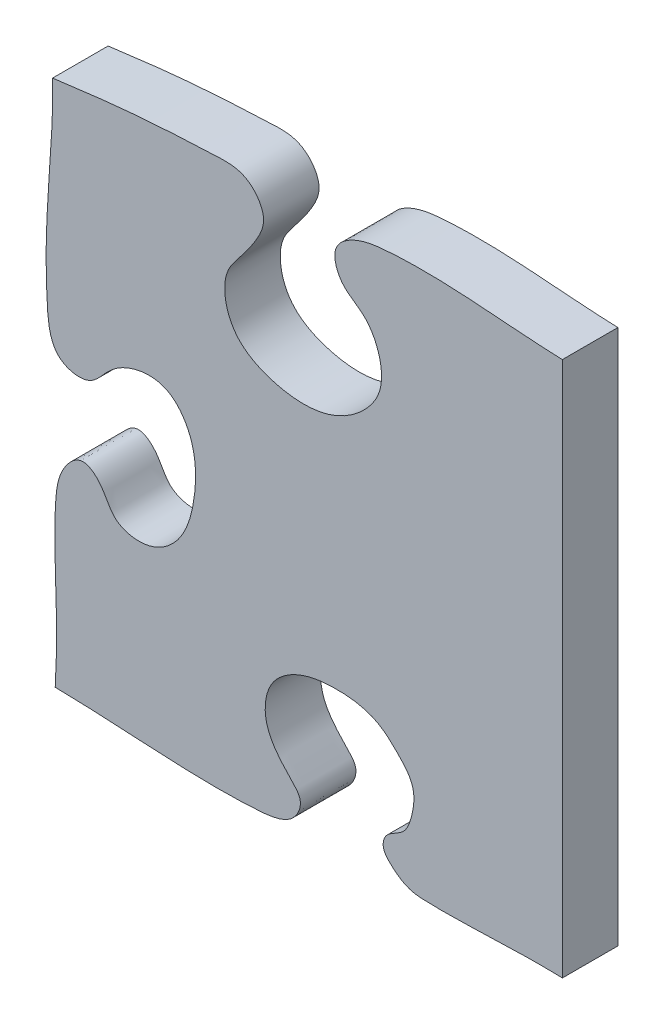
ISO-10303-21;
HEADER;
FILE_DESCRIPTION(('STEP AP214'),'2;1');
FILE_NAME('part.step','',(''),(''),'','','');
FILE_SCHEMA(('AUTOMOTIVE_DESIGN { 1 0 10303 214 1 1 1 1 }'));
ENDSEC;
DATA;
#1=APPLICATION_CONTEXT('core data for automotive mechanical design processes');
#2=APPLICATION_PROTOCOL_DEFINITION('international standard','automotive_design',2000,#1);
#3=PRODUCT_CONTEXT('',#1,'mechanical');
#4=PRODUCT('Part','Part','',(#3));
#5=PRODUCT_RELATED_PRODUCT_CATEGORY('part','',(#4));
#6=PRODUCT_DEFINITION_FORMATION('','',#4);
#7=PRODUCT_DEFINITION_CONTEXT('part definition',#1,'design');
#8=PRODUCT_DEFINITION('design','',#6,#7);
#9=PRODUCT_DEFINITION_SHAPE('','',#8);
#10=(LENGTH_UNIT() NAMED_UNIT(*) SI_UNIT(.MILLI.,.METRE.));
#11=(NAMED_UNIT(*) PLANE_ANGLE_UNIT() SI_UNIT($,.RADIAN.));
#12=(NAMED_UNIT(*) SI_UNIT($,.STERADIAN.) SOLID_ANGLE_UNIT());
#13=UNCERTAINTY_MEASURE_WITH_UNIT(LENGTH_MEASURE(1.E-05),#10,'distance_accuracy_value','');
#14=(GEOMETRIC_REPRESENTATION_CONTEXT(3) GLOBAL_UNCERTAINTY_ASSIGNED_CONTEXT((#13)) GLOBAL_UNIT_ASSIGNED_CONTEXT((#10,
#11,#12)) REPRESENTATION_CONTEXT('',''));
#15=CARTESIAN_POINT('',(0.,0.,0.));
#16=DIRECTION('',(0.,0.,1.));
#17=DIRECTION('',(1.,0.,0.));
#18=AXIS2_PLACEMENT_3D('',#15,#16,#17);
#19=CARTESIAN_POINT('',(325.257058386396,356.,-0.00999999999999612));
#20=CARTESIAN_POINT('',(320.961162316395,345.029410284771,-0.00999999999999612));
#21=CARTESIAN_POINT('',(320.821863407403,330.111228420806,-0.00999999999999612));
#22=CARTESIAN_POINT('',(317.746642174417,310.708405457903,-0.00999999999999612));
#23=CARTESIAN_POINT('',(324.80874526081,302.068845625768,-0.00999999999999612));
#24=CARTESIAN_POINT('',(334.47949844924,301.092198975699,-0.00999999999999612));
#25=CARTESIAN_POINT('',(341.199385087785,308.405018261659,-0.00999999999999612));
#26=CARTESIAN_POINT('',(351.88918877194,310.104343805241,-0.00999999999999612));
#27=CARTESIAN_POINT('',(365.477229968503,308.551893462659,-0.00999999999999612));
#28=CARTESIAN_POINT('',(373.973100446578,293.452904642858,-0.00999999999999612));
#29=CARTESIAN_POINT('',(374.68177629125,275.222888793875,-0.00999999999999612));
#30=CARTESIAN_POINT('',(363.969524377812,260.217712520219,-0.00999999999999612));
#31=CARTESIAN_POINT('',(347.560929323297,258.00994019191,-0.00999999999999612));
#32=CARTESIAN_POINT('',(341.667769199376,269.318092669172,-0.00999999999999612));
#33=CARTESIAN_POINT('',(329.050646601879,268.591464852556,-0.00999999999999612));
#34=CARTESIAN_POINT('',(320.333215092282,258.695380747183,-0.00999999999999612));
#35=CARTESIAN_POINT('',(321.071783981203,237.536716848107,-0.00999999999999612));
#36=CARTESIAN_POINT('',(324.445641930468,214.63289279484,-0.00999999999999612));
#37=CARTESIAN_POINT('',(329.382935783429,185.164436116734,-0.00999999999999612));
#38=CARTESIAN_POINT('',(327.148862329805,151.381238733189,-0.00999999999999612));
#39=CARTESIAN_POINT('',(325.104399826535,122.782989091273,-0.00999999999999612));
#40=CARTESIAN_POINT('',(327.870971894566,95.9027200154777,-0.00999999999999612));
#41=CARTESIAN_POINT('',(342.142457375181,93.3383677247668,-0.00999999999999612));
#42=CARTESIAN_POINT('',(347.900573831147,101.981576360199,-0.00999999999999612));
#43=CARTESIAN_POINT('',(356.834615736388,107.765098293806,-0.00999999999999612));
#44=CARTESIAN_POINT('',(369.379527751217,108.600772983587,-0.00999999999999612));
#45=CARTESIAN_POINT('',(380.120269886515,95.9775166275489,-0.00999999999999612));
#46=CARTESIAN_POINT('',(380.578851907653,78.7451628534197,-0.00999999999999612));
#47=CARTESIAN_POINT('',(375.610818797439,61.7248962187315,-0.00999999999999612));
#48=CARTESIAN_POINT('',(363.715824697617,52.8157722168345,-0.00999999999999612));
#49=CARTESIAN_POINT('',(349.85984979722,55.1705340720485,-0.00999999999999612));
#50=CARTESIAN_POINT('',(346.945856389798,64.810819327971,-0.00999999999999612));
#51=CARTESIAN_POINT('',(338.689797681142,70.9897723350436,-0.00999999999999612));
#52=CARTESIAN_POINT('',(330.580353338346,62.4728514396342,-0.00999999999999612));
#53=CARTESIAN_POINT('',(328.928359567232,48.4436203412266,-0.00999999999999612));
#54=CARTESIAN_POINT('',(329.318852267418,30.6791591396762,-0.00999999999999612));
#55=CARTESIAN_POINT('',(330.266196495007,6.75725364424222,-0.00999999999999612));
#56=CARTESIAN_POINT('',(328.413221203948,-22.8156731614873,-0.00999999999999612));
#57=CARTESIAN_POINT('',(325.957403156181,-47.4645191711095,-0.00999999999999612));
#58=CARTESIAN_POINT('',(324.284943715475,-71.7282942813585,-0.00999999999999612));
#59=CARTESIAN_POINT('',(336.158184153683,-74.5800053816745,-0.00999999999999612));
#60=CARTESIAN_POINT('',(345.605596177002,-70.2479425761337,-0.00999999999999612));
#61=CARTESIAN_POINT('',(352.349142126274,-60.6528291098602,-0.00999999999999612));
#62=CARTESIAN_POINT('',(364.054661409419,-61.084248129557,-0.00999999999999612));
#63=CARTESIAN_POINT('',(376.894401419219,-65.7171784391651,-0.00999999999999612));
#64=CARTESIAN_POINT('',(383.833690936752,-81.7570856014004,-0.00999999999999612));
#65=CARTESIAN_POINT('',(380.385627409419,-99.5380411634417,-0.00999999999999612));
#66=CARTESIAN_POINT('',(369.163029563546,-108.064440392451,-0.00999999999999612));
#67=CARTESIAN_POINT('',(355.487733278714,-112.894616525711,-0.00999999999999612));
#68=CARTESIAN_POINT('',(345.56890588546,-106.804716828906,-0.00999999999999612));
#69=CARTESIAN_POINT('',(337.864154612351,-99.6791187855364,-0.00999999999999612));
#70=CARTESIAN_POINT('',(325.333875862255,-101.340144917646,-0.00999999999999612));
#71=CARTESIAN_POINT('',(326.442256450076,-127.027418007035,-0.00999999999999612));
#72=CARTESIAN_POINT('',(328.990782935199,-147.650339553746,-0.00999999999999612));
#73=CARTESIAN_POINT('',(331.889209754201,-175.720931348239,-0.00999999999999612));
#74=CARTESIAN_POINT('',(333.49389611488,-200.043501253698,-0.00999999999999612));
#75=CARTESIAN_POINT('',(333.062418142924,-222.75850264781,-0.00999999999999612));
#76=CARTESIAN_POINT('',(334.041200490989,-241.335918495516,-0.00999999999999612));
#77=CARTESIAN_POINT('',(324.292862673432,-248.82670983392,-0.00999999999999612));
#78=CARTESIAN_POINT('',(313.862264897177,-249.831348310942,-0.00999999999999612));
#79=CARTESIAN_POINT('',(308.055191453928,-242.821422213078,-0.00999999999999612));
#80=CARTESIAN_POINT('',(300.480173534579,-235.015509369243,-0.00999999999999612));
#81=CARTESIAN_POINT('',(285.021810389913,-234.387092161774,-0.00999999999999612));
#82=CARTESIAN_POINT('',(274.179995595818,-248.432983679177,-0.00999999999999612));
#83=CARTESIAN_POINT('',(270.871780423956,-265.971502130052,-0.00999999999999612));
#84=CARTESIAN_POINT('',(274.212392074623,-284.032454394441,-0.00999999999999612));
#85=CARTESIAN_POINT('',(287.225269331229,-295.05235393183,-0.00999999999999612));
#86=CARTESIAN_POINT('',(300.809811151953,-292.931473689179,-0.00999999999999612));
#87=CARTESIAN_POINT('',(307.364923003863,-284.321305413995,-0.00999999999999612));
#88=CARTESIAN_POINT('',(317.634904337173,-281.646810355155,-0.00999999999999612));
#89=CARTESIAN_POINT('',(335.194502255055,-286.515768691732,-0.00999999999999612));
#90=CARTESIAN_POINT('',(329.900008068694,-321.054322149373,-0.00999999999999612));
#91=CARTESIAN_POINT('',(330.939416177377,-339.80390498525,-0.00999999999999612));
#92=CARTESIAN_POINT('',(328.124742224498,-356.,-0.00999999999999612));
#93=B_SPLINE_CURVE_WITH_KNOTS('',3,(#19,#20,#21,#22,#23,#24,#25,#26,#27,#28,#29,#30,#31,#32,#33,
#34,#35,#36,#37,#38,#39,#40,#41,#42,#43,#44,#45,#46,#47,#48,#49,#50,#51,#52,#53,#54,#55,#56,#57,
#58,#59,#60,#61,#62,#63,#64,#65,#66,#67,#68,#69,#70,#71,#72,#73,#74,#75,#76,#77,#78,#79,#80,#81,
#82,#83,#84,#85,#86,#87,#88,#89,#90,#91,#92),.UNSPECIFIED.,.F.,.F.,(4,1,1,1,1,1,1,1,1,1,1,1,1,1,
1,1,1,1,1,1,1,1,1,1,1,1,1,1,1,1,1,1,1,1,1,1,1,1,1,1,1,1,1,1,1,1,1,1,1,1,1,1,1,1,1,1,1,1,1,1,1,1,
1,1,1,1,1,1,1,1,1,4),(0.,0.0294359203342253,0.0410015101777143,0.0482578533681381,
0.056156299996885,0.0628725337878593,0.0726761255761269,0.0834491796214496,0.0961628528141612,
0.113582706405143,0.1292026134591,0.140393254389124,0.149299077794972,0.1578234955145,
0.168702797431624,0.18034067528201,0.211171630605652,0.230177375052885,0.258218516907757,
0.297936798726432,0.310855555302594,0.319545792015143,0.327782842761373,0.335750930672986,
0.347377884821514,0.35651553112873,0.375682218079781,0.389966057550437,0.401463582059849,
0.411615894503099,0.420595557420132,0.426581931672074,0.43417370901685,0.444880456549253,
0.464136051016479,0.480140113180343,0.507902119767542,0.539252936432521,0.552990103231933,
0.558383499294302,0.567729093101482,0.578921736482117,0.586248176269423,0.596305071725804,
0.613504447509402,0.626237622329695,0.64117705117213,0.647978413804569,0.662971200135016,
0.667795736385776,0.675224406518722,0.689293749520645,0.721613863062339,0.73643728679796,
0.762019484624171,0.785031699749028,0.797726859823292,0.806664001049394,0.814473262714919,
0.822386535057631,0.828765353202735,0.842978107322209,0.855573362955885,0.871677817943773,
0.889062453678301,0.900888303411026,0.912516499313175,0.920249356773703,0.928039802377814,
0.939164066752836,0.961164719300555,1.),.UNSPECIFIED.);
#94=DIRECTION('',(0.,0.,1.));
#95=VECTOR('',#94,1.);
#96=SURFACE_OF_LINEAR_EXTRUSION('',#93,#95);
#97=CARTESIAN_POINT('',(325.257058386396,356.,20.));
#98=CARTESIAN_POINT('',(320.961162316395,345.029410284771,20.));
#99=CARTESIAN_POINT('',(320.821863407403,330.111228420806,20.));
#100=CARTESIAN_POINT('',(317.746642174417,310.708405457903,20.));
#101=CARTESIAN_POINT('',(324.80874526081,302.068845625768,20.));
#102=CARTESIAN_POINT('',(334.47949844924,301.092198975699,20.));
#103=CARTESIAN_POINT('',(341.199385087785,308.405018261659,20.));
#104=CARTESIAN_POINT('',(351.88918877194,310.104343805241,20.));
#105=CARTESIAN_POINT('',(365.477229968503,308.551893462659,20.));
#106=CARTESIAN_POINT('',(373.973100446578,293.452904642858,20.));
#107=CARTESIAN_POINT('',(374.68177629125,275.222888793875,20.));
#108=CARTESIAN_POINT('',(363.969524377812,260.217712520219,20.));
#109=CARTESIAN_POINT('',(347.560929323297,258.00994019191,20.));
#110=CARTESIAN_POINT('',(341.667769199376,269.318092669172,20.));
#111=CARTESIAN_POINT('',(329.050646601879,268.591464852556,20.));
#112=CARTESIAN_POINT('',(320.333215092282,258.695380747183,20.));
#113=CARTESIAN_POINT('',(321.071783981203,237.536716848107,20.));
#114=CARTESIAN_POINT('',(324.445641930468,214.63289279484,20.));
#115=CARTESIAN_POINT('',(329.382935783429,185.164436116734,20.));
#116=CARTESIAN_POINT('',(327.148862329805,151.381238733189,20.));
#117=CARTESIAN_POINT('',(325.104399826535,122.782989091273,20.));
#118=CARTESIAN_POINT('',(327.870971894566,95.9027200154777,20.));
#119=CARTESIAN_POINT('',(342.142457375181,93.3383677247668,20.));
#120=CARTESIAN_POINT('',(347.900573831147,101.981576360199,20.));
#121=CARTESIAN_POINT('',(356.834615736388,107.765098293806,20.));
#122=CARTESIAN_POINT('',(369.379527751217,108.600772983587,20.));
#123=CARTESIAN_POINT('',(380.120269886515,95.9775166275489,20.));
#124=CARTESIAN_POINT('',(380.578851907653,78.7451628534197,20.));
#125=CARTESIAN_POINT('',(375.610818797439,61.7248962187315,20.));
#126=CARTESIAN_POINT('',(363.715824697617,52.8157722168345,20.));
#127=CARTESIAN_POINT('',(349.85984979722,55.1705340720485,20.));
#128=CARTESIAN_POINT('',(346.945856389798,64.810819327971,20.));
#129=CARTESIAN_POINT('',(338.689797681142,70.9897723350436,20.));
#130=CARTESIAN_POINT('',(330.580353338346,62.4728514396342,20.));
#131=CARTESIAN_POINT('',(328.928359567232,48.4436203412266,20.));
#132=CARTESIAN_POINT('',(329.318852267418,30.6791591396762,20.));
#133=CARTESIAN_POINT('',(330.266196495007,6.75725364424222,20.));
#134=CARTESIAN_POINT('',(328.413221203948,-22.8156731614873,20.));
#135=CARTESIAN_POINT('',(325.957403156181,-47.4645191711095,20.));
#136=CARTESIAN_POINT('',(324.284943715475,-71.7282942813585,20.));
#137=CARTESIAN_POINT('',(336.158184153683,-74.5800053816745,20.));
#138=CARTESIAN_POINT('',(345.605596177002,-70.2479425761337,20.));
#139=CARTESIAN_POINT('',(352.349142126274,-60.6528291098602,20.));
#140=CARTESIAN_POINT('',(364.054661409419,-61.084248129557,20.));
#141=CARTESIAN_POINT('',(376.894401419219,-65.7171784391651,20.));
#142=CARTESIAN_POINT('',(383.833690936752,-81.7570856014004,20.));
#143=CARTESIAN_POINT('',(380.385627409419,-99.5380411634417,20.));
#144=CARTESIAN_POINT('',(369.163029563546,-108.064440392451,20.));
#145=CARTESIAN_POINT('',(355.487733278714,-112.894616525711,20.));
#146=CARTESIAN_POINT('',(345.56890588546,-106.804716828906,20.));
#147=CARTESIAN_POINT('',(337.864154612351,-99.6791187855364,20.));
#148=CARTESIAN_POINT('',(325.333875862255,-101.340144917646,20.));
#149=CARTESIAN_POINT('',(326.442256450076,-127.027418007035,20.));
#150=CARTESIAN_POINT('',(328.990782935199,-147.650339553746,20.));
#151=CARTESIAN_POINT('',(331.889209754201,-175.720931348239,20.));
#152=CARTESIAN_POINT('',(333.49389611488,-200.043501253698,20.));
#153=CARTESIAN_POINT('',(333.062418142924,-222.75850264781,20.));
#154=CARTESIAN_POINT('',(334.041200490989,-241.335918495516,20.));
#155=CARTESIAN_POINT('',(324.292862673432,-248.82670983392,20.));
#156=CARTESIAN_POINT('',(313.862264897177,-249.831348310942,20.));
#157=CARTESIAN_POINT('',(308.055191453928,-242.821422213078,20.));
#158=CARTESIAN_POINT('',(300.480173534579,-235.015509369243,20.));
#159=CARTESIAN_POINT('',(285.021810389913,-234.387092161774,20.));
#160=CARTESIAN_POINT('',(274.179995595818,-248.432983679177,20.));
#161=CARTESIAN_POINT('',(270.871780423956,-265.971502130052,20.));
#162=CARTESIAN_POINT('',(274.212392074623,-284.032454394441,20.));
#163=CARTESIAN_POINT('',(287.225269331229,-295.05235393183,20.));
#164=CARTESIAN_POINT('',(300.809811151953,-292.931473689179,20.));
#165=CARTESIAN_POINT('',(307.364923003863,-284.321305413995,20.));
#166=CARTESIAN_POINT('',(317.634904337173,-281.646810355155,20.));
#167=CARTESIAN_POINT('',(335.194502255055,-286.515768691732,20.));
#168=CARTESIAN_POINT('',(329.900008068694,-321.054322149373,20.));
#169=CARTESIAN_POINT('',(330.939416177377,-339.80390498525,20.));
#170=CARTESIAN_POINT('',(328.124742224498,-356.,20.));
#171=B_SPLINE_CURVE_WITH_KNOTS('',3,(#97,#98,#99,#100,#101,#102,#103,#104,#105,#106,#107,#108,
#109,#110,#111,#112,#113,#114,#115,#116,#117,#118,#119,#120,#121,#122,#123,#124,#125,#126,#127,
#128,#129,#130,#131,#132,#133,#134,#135,#136,#137,#138,#139,#140,#141,#142,#143,#144,#145,#146,
#147,#148,#149,#150,#151,#152,#153,#154,#155,#156,#157,#158,#159,#160,#161,#162,#163,#164,#165,
#166,#167,#168,#169,#170),.UNSPECIFIED.,.F.,.F.,(4,1,1,1,1,1,1,1,1,1,1,1,1,1,1,1,1,1,1,1,1,1,1,
1,1,1,1,1,1,1,1,1,1,1,1,1,1,1,1,1,1,1,1,1,1,1,1,1,1,1,1,1,1,1,1,1,1,1,1,1,1,1,1,1,1,1,1,1,1,1,1,
4),(0.,0.0294359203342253,0.0410015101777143,0.0482578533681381,0.056156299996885,
0.0628725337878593,0.0726761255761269,0.0834491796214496,0.0961628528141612,0.113582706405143,
0.1292026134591,0.140393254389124,0.149299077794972,0.1578234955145,0.168702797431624,
0.18034067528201,0.211171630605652,0.230177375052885,0.258218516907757,0.297936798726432,
0.310855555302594,0.319545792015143,0.327782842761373,0.335750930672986,0.347377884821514,
0.35651553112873,0.375682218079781,0.389966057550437,0.401463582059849,0.411615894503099,
0.420595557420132,0.426581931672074,0.43417370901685,0.444880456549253,0.464136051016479,
0.480140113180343,0.507902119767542,0.539252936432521,0.552990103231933,0.558383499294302,
0.567729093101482,0.578921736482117,0.586248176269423,0.596305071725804,0.613504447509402,
0.626237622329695,0.64117705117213,0.647978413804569,0.662971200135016,0.667795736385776,
0.675224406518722,0.689293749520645,0.721613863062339,0.73643728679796,0.762019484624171,
0.785031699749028,0.797726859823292,0.806664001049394,0.814473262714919,0.822386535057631,
0.828765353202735,0.842978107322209,0.855573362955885,0.871677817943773,0.889062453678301,
0.900888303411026,0.912516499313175,0.920249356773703,0.928039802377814,0.939164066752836,
0.961164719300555,1.),.UNSPECIFIED.);
#172=CARTESIAN_POINT('',(328.393413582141,183.083092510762,20.));
#173=VERTEX_POINT('',#172);
#174=CARTESIAN_POINT('',(329.347506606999,-6.46618719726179,20.));
#175=VERTEX_POINT('',#174);
#176=EDGE_CURVE('E91',#173,#175,#171,.T.);
#177=ORIENTED_EDGE('',*,*,#176,.F.);
#178=DIRECTION('',(0.,0.,1.));
#179=VECTOR('',#178,1.);
#180=CARTESIAN_POINT('',(328.393413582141,183.083092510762,-0.00999999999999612));
#181=LINE('',#180,#179);
#182=CARTESIAN_POINT('',(328.393413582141,183.083092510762,0.));
#183=VERTEX_POINT('',#182);
#184=EDGE_CURVE('E79',#173,#183,#181,.F.);
#185=ORIENTED_EDGE('',*,*,#184,.T.);
#186=CARTESIAN_POINT('',(325.257058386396,356.,0.));
#187=CARTESIAN_POINT('',(320.961162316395,345.029410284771,0.));
#188=CARTESIAN_POINT('',(320.821863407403,330.111228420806,0.));
#189=CARTESIAN_POINT('',(317.746642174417,310.708405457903,0.));
#190=CARTESIAN_POINT('',(324.80874526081,302.068845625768,0.));
#191=CARTESIAN_POINT('',(334.47949844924,301.092198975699,0.));
#192=CARTESIAN_POINT('',(341.199385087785,308.405018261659,0.));
#193=CARTESIAN_POINT('',(351.88918877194,310.104343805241,0.));
#194=CARTESIAN_POINT('',(365.477229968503,308.551893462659,0.));
#195=CARTESIAN_POINT('',(373.973100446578,293.452904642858,0.));
#196=CARTESIAN_POINT('',(374.68177629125,275.222888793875,0.));
#197=CARTESIAN_POINT('',(363.969524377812,260.217712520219,0.));
#198=CARTESIAN_POINT('',(347.560929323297,258.00994019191,0.));
#199=CARTESIAN_POINT('',(341.667769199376,269.318092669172,0.));
#200=CARTESIAN_POINT('',(329.050646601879,268.591464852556,0.));
#201=CARTESIAN_POINT('',(320.333215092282,258.695380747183,0.));
#202=CARTESIAN_POINT('',(321.071783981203,237.536716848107,0.));
#203=CARTESIAN_POINT('',(324.445641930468,214.63289279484,0.));
#204=CARTESIAN_POINT('',(329.382935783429,185.164436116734,0.));
#205=CARTESIAN_POINT('',(327.148862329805,151.381238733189,0.));
#206=CARTESIAN_POINT('',(325.104399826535,122.782989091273,0.));
#207=CARTESIAN_POINT('',(327.870971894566,95.9027200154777,0.));
#208=CARTESIAN_POINT('',(342.142457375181,93.3383677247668,0.));
#209=CARTESIAN_POINT('',(347.900573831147,101.981576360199,0.));
#210=CARTESIAN_POINT('',(356.834615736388,107.765098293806,0.));
#211=CARTESIAN_POINT('',(369.379527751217,108.600772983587,0.));
#212=CARTESIAN_POINT('',(380.120269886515,95.9775166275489,0.));
#213=CARTESIAN_POINT('',(380.578851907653,78.7451628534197,0.));
#214=CARTESIAN_POINT('',(375.610818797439,61.7248962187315,0.));
#215=CARTESIAN_POINT('',(363.715824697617,52.8157722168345,0.));
#216=CARTESIAN_POINT('',(349.85984979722,55.1705340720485,0.));
#217=CARTESIAN_POINT('',(346.945856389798,64.810819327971,0.));
#218=CARTESIAN_POINT('',(338.689797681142,70.9897723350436,0.));
#219=CARTESIAN_POINT('',(330.580353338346,62.4728514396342,0.));
#220=CARTESIAN_POINT('',(328.928359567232,48.4436203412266,0.));
#221=CARTESIAN_POINT('',(329.318852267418,30.6791591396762,0.));
#222=CARTESIAN_POINT('',(330.266196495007,6.75725364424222,0.));
#223=CARTESIAN_POINT('',(328.413221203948,-22.8156731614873,0.));
#224=CARTESIAN_POINT('',(325.957403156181,-47.4645191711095,0.));
#225=CARTESIAN_POINT('',(324.284943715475,-71.7282942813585,0.));
#226=CARTESIAN_POINT('',(336.158184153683,-74.5800053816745,0.));
#227=CARTESIAN_POINT('',(345.605596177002,-70.2479425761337,0.));
#228=CARTESIAN_POINT('',(352.349142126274,-60.6528291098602,0.));
#229=CARTESIAN_POINT('',(364.054661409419,-61.084248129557,0.));
#230=CARTESIAN_POINT('',(376.894401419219,-65.7171784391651,0.));
#231=CARTESIAN_POINT('',(383.833690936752,-81.7570856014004,0.));
#232=CARTESIAN_POINT('',(380.385627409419,-99.5380411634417,0.));
#233=CARTESIAN_POINT('',(369.163029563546,-108.064440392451,0.));
#234=CARTESIAN_POINT('',(355.487733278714,-112.894616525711,0.));
#235=CARTESIAN_POINT('',(345.56890588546,-106.804716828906,0.));
#236=CARTESIAN_POINT('',(337.864154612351,-99.6791187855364,0.));
#237=CARTESIAN_POINT('',(325.333875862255,-101.340144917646,0.));
#238=CARTESIAN_POINT('',(326.442256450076,-127.027418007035,0.));
#239=CARTESIAN_POINT('',(328.990782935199,-147.650339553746,0.));
#240=CARTESIAN_POINT('',(331.889209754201,-175.720931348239,0.));
#241=CARTESIAN_POINT('',(333.49389611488,-200.043501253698,0.));
#242=CARTESIAN_POINT('',(333.062418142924,-222.75850264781,0.));
#243=CARTESIAN_POINT('',(334.041200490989,-241.335918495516,0.));
#244=CARTESIAN_POINT('',(324.292862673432,-248.82670983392,0.));
#245=CARTESIAN_POINT('',(313.862264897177,-249.831348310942,0.));
#246=CARTESIAN_POINT('',(308.055191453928,-242.821422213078,0.));
#247=CARTESIAN_POINT('',(300.480173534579,-235.015509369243,0.));
#248=CARTESIAN_POINT('',(285.021810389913,-234.387092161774,0.));
#249=CARTESIAN_POINT('',(274.179995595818,-248.432983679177,0.));
#250=CARTESIAN_POINT('',(270.871780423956,-265.971502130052,0.));
#251=CARTESIAN_POINT('',(274.212392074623,-284.032454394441,0.));
#252=CARTESIAN_POINT('',(287.225269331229,-295.05235393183,0.));
#253=CARTESIAN_POINT('',(300.809811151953,-292.931473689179,0.));
#254=CARTESIAN_POINT('',(307.364923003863,-284.321305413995,0.));
#255=CARTESIAN_POINT('',(317.634904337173,-281.646810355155,0.));
#256=CARTESIAN_POINT('',(335.194502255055,-286.515768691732,0.));
#257=CARTESIAN_POINT('',(329.900008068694,-321.054322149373,0.));
#258=CARTESIAN_POINT('',(330.939416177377,-339.80390498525,0.));
#259=CARTESIAN_POINT('',(328.124742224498,-356.,0.));
#260=B_SPLINE_CURVE_WITH_KNOTS('',3,(#186,#187,#188,#189,#190,#191,#192,#193,#194,#195,#196,
#197,#198,#199,#200,#201,#202,#203,#204,#205,#206,#207,#208,#209,#210,#211,#212,#213,#214,#215,
#216,#217,#218,#219,#220,#221,#222,#223,#224,#225,#226,#227,#228,#229,#230,#231,#232,#233,#234,
#235,#236,#237,#238,#239,#240,#241,#242,#243,#244,#245,#246,#247,#248,#249,#250,#251,#252,#253,
#254,#255,#256,#257,#258,#259),.UNSPECIFIED.,.F.,.F.,(4,1,1,1,1,1,1,1,1,1,1,1,1,1,1,1,1,1,1,1,1,
1,1,1,1,1,1,1,1,1,1,1,1,1,1,1,1,1,1,1,1,1,1,1,1,1,1,1,1,1,1,1,1,1,1,1,1,1,1,1,1,1,1,1,1,1,1,1,1,
1,1,4),(0.,0.0294359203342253,0.0410015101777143,0.0482578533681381,0.056156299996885,
0.0628725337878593,0.0726761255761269,0.0834491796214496,0.0961628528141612,0.113582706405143,
0.1292026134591,0.140393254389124,0.149299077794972,0.1578234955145,0.168702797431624,
0.18034067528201,0.211171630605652,0.230177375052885,0.258218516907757,0.297936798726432,
0.310855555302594,0.319545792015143,0.327782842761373,0.335750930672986,0.347377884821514,
0.35651553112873,0.375682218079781,0.389966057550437,0.401463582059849,0.411615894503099,
0.420595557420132,0.426581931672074,0.43417370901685,0.444880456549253,0.464136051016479,
0.480140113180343,0.507902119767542,0.539252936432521,0.552990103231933,0.558383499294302,
0.567729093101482,0.578921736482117,0.586248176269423,0.596305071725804,0.613504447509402,
0.626237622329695,0.64117705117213,0.647978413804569,0.662971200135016,0.667795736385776,
0.675224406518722,0.689293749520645,0.721613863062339,0.73643728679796,0.762019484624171,
0.785031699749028,0.797726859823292,0.806664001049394,0.814473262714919,0.822386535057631,
0.828765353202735,0.842978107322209,0.855573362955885,0.871677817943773,0.889062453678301,
0.900888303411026,0.912516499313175,0.920249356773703,0.928039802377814,0.939164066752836,
0.961164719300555,1.),.UNSPECIFIED.);
#261=CARTESIAN_POINT('',(329.347506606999,-6.46618719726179,0.));
#262=VERTEX_POINT('',#261);
#263=EDGE_CURVE('E90',#183,#262,#260,.T.);
#264=ORIENTED_EDGE('',*,*,#263,.T.);
#265=DIRECTION('',(0.,0.,1.));
#266=VECTOR('',#265,1.);
#267=CARTESIAN_POINT('',(329.347506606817,-6.46618719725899,-0.00999999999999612));
#268=LINE('',#267,#266);
#269=EDGE_CURVE('E92',#175,#262,#268,.F.);
#270=ORIENTED_EDGE('',*,*,#269,.F.);
#271=EDGE_LOOP('',(#177,#185,#264,#270));
#272=FACE_BOUND('',#271,.T.);
#273=ADVANCED_FACE('F34',(#272),#96,.T.);
#274=CARTESIAN_POINT('',(512.,-356.,20.));
#275=DIRECTION('',(-1.,0.,0.));
#276=DIRECTION('',(0.,0.,1.));
#277=AXIS2_PLACEMENT_3D('',#274,#275,#276);
#278=PLANE('',#277);
#279=DIRECTION('',(0.,1.,0.));
#280=VECTOR('',#279,1.);
#281=CARTESIAN_POINT('',(512.,-356.,0.));
#282=LINE('',#281,#280);
#283=CARTESIAN_POINT('',(512.,-5.81701820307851,0.));
#284=VERTEX_POINT('',#283);
#285=CARTESIAN_POINT('',(512.,187.076538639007,0.));
#286=VERTEX_POINT('',#285);
#287=EDGE_CURVE('E107',#284,#286,#282,.T.);
#288=ORIENTED_EDGE('',*,*,#287,.T.);
#289=DIRECTION('',(0.,0.,1.));
#290=VECTOR('',#289,1.);
#291=CARTESIAN_POINT('',(512.,187.076538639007,-0.00999999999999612));
#292=LINE('',#291,#290);
#293=CARTESIAN_POINT('',(512.,187.076538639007,20.));
#294=VERTEX_POINT('',#293);
#295=EDGE_CURVE('E80',#286,#294,#292,.T.);
#296=ORIENTED_EDGE('',*,*,#295,.T.);
#297=DIRECTION('',(0.,1.,0.));
#298=VECTOR('',#297,1.);
#299=CARTESIAN_POINT('',(512.,-356.,20.));
#300=LINE('',#299,#298);
#301=CARTESIAN_POINT('',(512.,-5.81701820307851,20.));
#302=VERTEX_POINT('',#301);
#303=EDGE_CURVE('E85',#302,#294,#300,.T.);
#304=ORIENTED_EDGE('',*,*,#303,.F.);
#305=DIRECTION('',(0.,0.,1.));
#306=VECTOR('',#305,1.);
#307=CARTESIAN_POINT('',(512.,-5.81701820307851,-0.00999999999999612));
#308=LINE('',#307,#306);
#309=EDGE_CURVE('E147',#284,#302,#308,.T.);
#310=ORIENTED_EDGE('',*,*,#309,.F.);
#311=EDGE_LOOP('',(#288,#296,#304,#310));
#312=FACE_BOUND('',#311,.T.);
#313=ADVANCED_FACE('F124',(#312),#278,.F.);
#314=CARTESIAN_POINT('',(-349.139880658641,5.30046994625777,-0.00999999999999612));
#315=CARTESIAN_POINT('',(-339.887860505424,5.11479546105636,-0.00999999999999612));
#316=CARTESIAN_POINT('',(-319.891606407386,5.70075392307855,-0.00999999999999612));
#317=CARTESIAN_POINT('',(-312.057252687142,6.39377361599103,-0.00999999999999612));
#318=CARTESIAN_POINT('',(-295.557040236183,6.5821024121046,-0.00999999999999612));
#319=CARTESIAN_POINT('',(-287.520649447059,5.38238329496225,-0.00999999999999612));
#320=CARTESIAN_POINT('',(-282.231232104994,-0.739375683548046,-0.00999999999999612));
#321=CARTESIAN_POINT('',(-284.631758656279,-6.70157001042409,-0.00999999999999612));
#322=CARTESIAN_POINT('',(-290.291633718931,-11.4270553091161,-0.00999999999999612));
#323=CARTESIAN_POINT('',(-294.264404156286,-19.1154923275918,-0.00999999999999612));
#324=CARTESIAN_POINT('',(-294.324045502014,-31.0075730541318,-0.00999999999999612));
#325=CARTESIAN_POINT('',(-285.696757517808,-42.2618535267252,-0.00999999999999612));
#326=CARTESIAN_POINT('',(-271.389959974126,-47.4058055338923,-0.00999999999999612));
#327=CARTESIAN_POINT('',(-259.358947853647,-47.5927514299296,-0.00999999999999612));
#328=CARTESIAN_POINT('',(-248.949507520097,-41.269541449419,-0.00999999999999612));
#329=CARTESIAN_POINT('',(-243.879910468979,-32.2576865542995,-0.00999999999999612));
#330=CARTESIAN_POINT('',(-242.928014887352,-21.7896256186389,-0.00999999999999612));
#331=CARTESIAN_POINT('',(-249.227477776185,-14.851631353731,-0.00999999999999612));
#332=CARTESIAN_POINT('',(-254.593465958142,-9.43942563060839,-0.00999999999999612));
#333=CARTESIAN_POINT('',(-258.137345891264,-1.50662300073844,-0.00999999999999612));
#334=CARTESIAN_POINT('',(-253.898534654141,5.55474508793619,-0.00999999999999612));
#335=CARTESIAN_POINT('',(-243.567188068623,7.43755302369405,-0.00999999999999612));
#336=CARTESIAN_POINT('',(-237.879490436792,6.8669695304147,-0.00999999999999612));
#337=CARTESIAN_POINT('',(-212.535663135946,4.31355413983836,-0.00999999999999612));
#338=CARTESIAN_POINT('',(-204.857637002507,3.06770049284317,-0.00999999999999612));
#339=CARTESIAN_POINT('',(-187.870824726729,0.576823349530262,-0.00999999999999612));
#340=CARTESIAN_POINT('',(-180.873341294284,-0.585089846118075,-0.00999999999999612));
#341=CARTESIAN_POINT('',(-167.321297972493,-4.05861827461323,-0.00999999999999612));
#342=CARTESIAN_POINT('',(-158.264072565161,-5.81322262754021,-0.00999999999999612));
#343=CARTESIAN_POINT('',(-139.329328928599,-8.34288673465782,-0.00999999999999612));
#344=CARTESIAN_POINT('',(-132.040798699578,-2.9845391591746,-0.00999999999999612));
#345=CARTESIAN_POINT('',(-129.761885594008,4.23046807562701,-0.00999999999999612));
#346=CARTESIAN_POINT('',(-131.710784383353,10.4013258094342,-0.00999999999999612));
#347=CARTESIAN_POINT('',(-133.710968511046,14.6601816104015,-0.00999999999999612));
#348=CARTESIAN_POINT('',(-138.026269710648,21.724753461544,-0.00999999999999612));
#349=CARTESIAN_POINT('',(-138.081917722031,32.3728530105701,-0.00999999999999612));
#350=CARTESIAN_POINT('',(-131.83570692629,43.0815337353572,-0.00999999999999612));
#351=CARTESIAN_POINT('',(-119.794248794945,47.304204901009,-0.00999999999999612));
#352=CARTESIAN_POINT('',(-108.957899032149,47.5382470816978,-0.00999999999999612));
#353=CARTESIAN_POINT('',(-96.8719484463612,45.7015776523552,-0.00999999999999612));
#354=CARTESIAN_POINT('',(-87.0853124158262,37.0457421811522,-0.00999999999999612));
#355=CARTESIAN_POINT('',(-87.3806461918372,25.6113797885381,-0.00999999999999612));
#356=CARTESIAN_POINT('',(-91.1138584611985,18.4470720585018,-0.00999999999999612));
#357=CARTESIAN_POINT('',(-96.1690771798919,13.9582424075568,-0.00999999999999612));
#358=CARTESIAN_POINT('',(-97.7539111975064,6.63580226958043,-0.00999999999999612));
#359=CARTESIAN_POINT('',(-93.1531213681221,0.225805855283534,-0.00999999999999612));
#360=CARTESIAN_POINT('',(-85.7868945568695,-4.22125029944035,-0.00999999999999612));
#361=CARTESIAN_POINT('',(-75.4922823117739,-4.72742713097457,-0.00999999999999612));
#362=CARTESIAN_POINT('',(-63.6021774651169,-3.739894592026,-0.00999999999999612));
#363=CARTESIAN_POINT('',(-47.1576847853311,-2.15281130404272,-0.00999999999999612));
#364=CARTESIAN_POINT('',(-35.4735305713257,-1.02782701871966,-0.00999999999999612));
#365=CARTESIAN_POINT('',(-9.55974097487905,5.44923466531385,-0.00999999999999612));
#366=CARTESIAN_POINT('',(5.33335319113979,5.64341864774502,-0.00999999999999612));
#367=CARTESIAN_POINT('',(26.8877087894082,6.61154693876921,-0.00999999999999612));
#368=CARTESIAN_POINT('',(40.3616385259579,6.66752296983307,-0.00999999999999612));
#369=CARTESIAN_POINT('',(55.4069140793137,6.55682515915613,-0.00999999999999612));
#370=CARTESIAN_POINT('',(60.9823316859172,-1.76204700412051,-0.00999999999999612));
#371=CARTESIAN_POINT('',(62.7286219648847,-10.7101888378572,-0.00999999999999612));
#372=CARTESIAN_POINT('',(58.0719160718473,-18.2162229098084,-0.00999999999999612));
#373=CARTESIAN_POINT('',(50.4934538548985,-22.6369036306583,-0.00999999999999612));
#374=CARTESIAN_POINT('',(49.5191525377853,-32.4601424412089,-0.00999999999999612));
#375=CARTESIAN_POINT('',(50.9102608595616,-43.3041677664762,-0.00999999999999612));
#376=CARTESIAN_POINT('',(60.9494806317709,-51.7611152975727,-0.00999999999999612));
#377=CARTESIAN_POINT('',(73.8438777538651,-54.9427485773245,-0.00999999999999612));
#378=CARTESIAN_POINT('',(86.4324503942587,-54.0451489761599,-0.00999999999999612));
#379=CARTESIAN_POINT('',(96.2763408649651,-49.8211627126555,-0.00999999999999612));
#380=CARTESIAN_POINT('',(101.788676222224,-42.6926438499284,-0.00999999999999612));
#381=CARTESIAN_POINT('',(103.785622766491,-33.9307441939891,-0.00999999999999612));
#382=CARTESIAN_POINT('',(101.793989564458,-26.0744158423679,-0.00999999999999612));
#383=CARTESIAN_POINT('',(95.2302198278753,-18.82812621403,-0.00999999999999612));
#384=CARTESIAN_POINT('',(89.6165079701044,-10.8535457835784,-0.00999999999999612));
#385=CARTESIAN_POINT('',(88.5833289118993,0.119561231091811,-0.00999999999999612));
#386=CARTESIAN_POINT('',(98.1406475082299,6.80161389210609,-0.00999999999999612));
#387=CARTESIAN_POINT('',(110.075702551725,4.83412068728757,-0.00999999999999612));
#388=CARTESIAN_POINT('',(121.713926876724,4.79342247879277,-0.00999999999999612));
#389=CARTESIAN_POINT('',(136.161134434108,3.20442078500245,-0.00999999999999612));
#390=CARTESIAN_POINT('',(149.301551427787,2.24618232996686,-0.00999999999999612));
#391=CARTESIAN_POINT('',(163.635697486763,1.11607382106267,-0.00999999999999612));
#392=CARTESIAN_POINT('',(175.743984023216,-0.930199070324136,-0.00999999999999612));
#393=CARTESIAN_POINT('',(193.50042565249,-4.03526402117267,-0.00999999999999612));
#394=CARTESIAN_POINT('',(199.307125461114,-4.82007249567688,-0.00999999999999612));
#395=CARTESIAN_POINT('',(223.191668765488,-7.20796265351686,-0.00999999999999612));
#396=CARTESIAN_POINT('',(234.005762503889,-7.89583073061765,-0.00999999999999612));
#397=CARTESIAN_POINT('',(243.165304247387,-4.21144732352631,-0.00999999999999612));
#398=CARTESIAN_POINT('',(242.728227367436,5.29385628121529,-0.00999999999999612));
#399=CARTESIAN_POINT('',(239.691190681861,13.3923508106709,-0.00999999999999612));
#400=CARTESIAN_POINT('',(230.992924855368,17.259551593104,-0.00999999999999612));
#401=CARTESIAN_POINT('',(228.562234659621,35.6530691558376,-0.00999999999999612));
#402=CARTESIAN_POINT('',(241.485133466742,51.1639498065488,-0.00999999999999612));
#403=CARTESIAN_POINT('',(261.294428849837,50.4989765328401,-0.00999999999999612));
#404=CARTESIAN_POINT('',(273.311157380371,41.2796485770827,-0.00999999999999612));
#405=CARTESIAN_POINT('',(278.244185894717,29.7939334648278,-0.00999999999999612));
#406=CARTESIAN_POINT('',(278.46311043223,19.1716807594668,-0.00999999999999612));
#407=CARTESIAN_POINT('',(273.41239647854,11.7823053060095,-0.00999999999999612));
#408=CARTESIAN_POINT('',(269.462797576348,8.07180362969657,-0.00999999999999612));
#409=CARTESIAN_POINT('',(268.275297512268,1.27447756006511,-0.00999999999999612));
#410=CARTESIAN_POINT('',(269.56536006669,-2.1294813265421,-0.00999999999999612));
#411=CARTESIAN_POINT('',(273.239630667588,-8.77034024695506,-0.00999999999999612));
#412=CARTESIAN_POINT('',(289.550418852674,-6.96961632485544,-0.00999999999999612));
#413=CARTESIAN_POINT('',(304.280714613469,-6.71047567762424,-0.00999999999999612));
#414=CARTESIAN_POINT('',(324.326281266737,-6.23084088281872,-0.00999999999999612));
#415=CARTESIAN_POINT('',(349.235083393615,-7.00547217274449,-0.00999999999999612));
#416=CARTESIAN_POINT('',(375.517421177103,-8.89168640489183,-0.00999999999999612));
#417=CARTESIAN_POINT('',(398.91687007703,-8.79198570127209,-0.00999999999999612));
#418=CARTESIAN_POINT('',(415.173568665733,-7.26147865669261,-0.00999999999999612));
#419=CARTESIAN_POINT('',(418.590464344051,2.48372200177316,-0.00999999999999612));
#420=CARTESIAN_POINT('',(414.376255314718,7.33198876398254,-0.00999999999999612));
#421=CARTESIAN_POINT('',(409.420059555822,12.1922927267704,-0.00999999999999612));
#422=CARTESIAN_POINT('',(403.982345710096,21.0196469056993,-0.00999999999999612));
#423=CARTESIAN_POINT('',(405.486454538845,34.4252863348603,-0.00999999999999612));
#424=CARTESIAN_POINT('',(417.292648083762,42.4744659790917,-0.00999999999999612));
#425=CARTESIAN_POINT('',(430.971964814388,44.2079105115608,-0.00999999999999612));
#426=CARTESIAN_POINT('',(444.367703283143,42.5130395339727,-0.00999999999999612));
#427=CARTESIAN_POINT('',(452.635026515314,34.8362400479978,-0.00999999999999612));
#428=CARTESIAN_POINT('',(459.310429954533,27.5027807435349,-0.00999999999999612));
#429=CARTESIAN_POINT('',(458.249050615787,18.2902890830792,-0.00999999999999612));
#430=CARTESIAN_POINT('',(455.302955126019,10.0877891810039,-0.00999999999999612));
#431=CARTESIAN_POINT('',(448.406360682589,8.30941704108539,-0.00999999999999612));
#432=CARTESIAN_POINT('',(446.811865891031,2.1759580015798,-0.00999999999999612));
#433=CARTESIAN_POINT('',(451.102211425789,-2.40101244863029,-0.00999999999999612));
#434=CARTESIAN_POINT('',(456.533203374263,-6.13416812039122,-0.00999999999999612));
#435=CARTESIAN_POINT('',(468.262453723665,-6.69921981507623,-0.00999999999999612));
#436=CARTESIAN_POINT('',(486.320062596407,-6.06999038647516,-0.00999999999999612));
#437=CARTESIAN_POINT('',(502.630044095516,-5.50396307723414,-0.00999999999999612));
#438=CARTESIAN_POINT('',(512.,-5.81701820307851,-0.00999999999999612));
#439=B_SPLINE_CURVE_WITH_KNOTS('',3,(#314,#315,#316,#317,#318,#319,#320,#321,#322,#323,#324,
#325,#326,#327,#328,#329,#330,#331,#332,#333,#334,#335,#336,#337,#338,#339,#340,#341,#342,#343,
#344,#345,#346,#347,#348,#349,#350,#351,#352,#353,#354,#355,#356,#357,#358,#359,#360,#361,#362,
#363,#364,#365,#366,#367,#368,#369,#370,#371,#372,#373,#374,#375,#376,#377,#378,#379,#380,#381,
#382,#383,#384,#385,#386,#387,#388,#389,#390,#391,#392,#393,#394,#395,#396,#397,#398,#399,#400,
#401,#402,#403,#404,#405,#406,#407,#408,#409,#410,#411,#412,#413,#414,#415,#416,#417,#418,#419,
#420,#421,#422,#423,#424,#425,#426,#427,#428,#429,#430,#431,#432,#433,#434,#435,#436,#437,#438),
.UNSPECIFIED.,.F.,.F.,(4,1,1,1,1,1,1,1,1,1,1,1,1,1,1,1,1,1,1,1,1,1,1,1,1,1,1,1,1,1,1,1,1,1,1,1,
1,1,1,1,1,1,1,1,1,1,1,1,1,1,1,1,1,1,1,1,1,1,1,1,1,1,1,1,1,1,1,1,1,1,1,1,1,1,1,1,1,1,1,1,1,1,1,1,
1,1,1,1,1,1,1,1,1,1,1,1,1,1,1,1,1,1,1,1,1,1,1,1,1,1,1,1,1,1,1,1,1,1,1,1,1,1,4),(0.,
0.0203999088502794,0.032525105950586,0.0394079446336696,0.0429925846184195,0.0462028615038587,
0.0506774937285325,0.05482191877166,0.0612964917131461,0.0675853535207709,0.078206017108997,
0.0877657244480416,0.0973648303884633,0.104223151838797,0.110287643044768,0.118436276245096,
0.123325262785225,0.128697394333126,0.134348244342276,0.139464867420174,0.143004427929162,
0.154029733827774,0.165686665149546,0.174632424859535,0.180824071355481,0.188209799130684,
0.201784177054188,0.211152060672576,0.219187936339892,0.223061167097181,0.227413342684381,
0.231609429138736,0.235336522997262,0.240285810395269,0.247100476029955,0.256480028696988,
0.263295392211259,0.272209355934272,0.278498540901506,0.288104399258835,0.295607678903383,
0.299979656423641,0.304345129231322,0.309246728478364,0.313548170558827,0.319553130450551,
0.326293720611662,0.334109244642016,0.344082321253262,0.358264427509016,0.371018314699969,
0.38399064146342,0.394173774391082,0.409867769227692,0.416213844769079,0.42234168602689,
0.428532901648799,0.433885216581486,0.439261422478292,0.445456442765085,0.452298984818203,
0.460789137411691,0.470177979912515,0.479006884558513,0.486257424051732,0.491194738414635,
0.497076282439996,0.50308023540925,0.509890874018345,0.515931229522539,0.523373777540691,
0.52915668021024,0.537122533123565,0.545469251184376,0.555096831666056,0.566261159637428,
0.572611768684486,0.584261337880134,0.592302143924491,0.605983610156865,0.612919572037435,
0.623596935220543,0.628810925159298,0.634556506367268,0.640074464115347,0.645822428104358,
0.653868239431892,0.669756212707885,0.681576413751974,0.690541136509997,0.699365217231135,
0.706297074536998,0.711452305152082,0.716102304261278,0.720612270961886,0.721498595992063,
0.724965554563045,0.740526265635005,0.750839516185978,0.768228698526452,0.782843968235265,
0.812887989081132,0.829663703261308,0.842004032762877,0.846827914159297,0.85066745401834,
0.856368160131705,0.863967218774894,0.874786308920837,0.884930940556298,0.895673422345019,
0.907978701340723,0.915432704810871,0.922621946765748,0.930503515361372,0.936383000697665,
0.942324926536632,0.945307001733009,0.949799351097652,0.956034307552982,0.960974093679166,
0.977389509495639,1.),.UNSPECIFIED.);
#440=DIRECTION('',(0.,0.,1.));
#441=VECTOR('',#440,1.);
#442=SURFACE_OF_LINEAR_EXTRUSION('',#439,#441);
#443=CARTESIAN_POINT('',(-349.139880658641,5.30046994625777,20.));
#444=CARTESIAN_POINT('',(-339.887860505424,5.11479546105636,20.));
#445=CARTESIAN_POINT('',(-319.891606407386,5.70075392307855,20.));
#446=CARTESIAN_POINT('',(-312.057252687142,6.39377361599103,20.));
#447=CARTESIAN_POINT('',(-295.557040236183,6.5821024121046,20.));
#448=CARTESIAN_POINT('',(-287.520649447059,5.38238329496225,20.));
#449=CARTESIAN_POINT('',(-282.231232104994,-0.739375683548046,20.));
#450=CARTESIAN_POINT('',(-284.631758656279,-6.70157001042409,20.));
#451=CARTESIAN_POINT('',(-290.291633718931,-11.4270553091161,20.));
#452=CARTESIAN_POINT('',(-294.264404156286,-19.1154923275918,20.));
#453=CARTESIAN_POINT('',(-294.324045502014,-31.0075730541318,20.));
#454=CARTESIAN_POINT('',(-285.696757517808,-42.2618535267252,20.));
#455=CARTESIAN_POINT('',(-271.389959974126,-47.4058055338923,20.));
#456=CARTESIAN_POINT('',(-259.358947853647,-47.5927514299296,20.));
#457=CARTESIAN_POINT('',(-248.949507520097,-41.269541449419,20.));
#458=CARTESIAN_POINT('',(-243.879910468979,-32.2576865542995,20.));
#459=CARTESIAN_POINT('',(-242.928014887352,-21.7896256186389,20.));
#460=CARTESIAN_POINT('',(-249.227477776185,-14.851631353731,20.));
#461=CARTESIAN_POINT('',(-254.593465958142,-9.43942563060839,20.));
#462=CARTESIAN_POINT('',(-258.137345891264,-1.50662300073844,20.));
#463=CARTESIAN_POINT('',(-253.898534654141,5.55474508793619,20.));
#464=CARTESIAN_POINT('',(-243.567188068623,7.43755302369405,20.));
#465=CARTESIAN_POINT('',(-237.879490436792,6.8669695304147,20.));
#466=CARTESIAN_POINT('',(-212.535663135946,4.31355413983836,20.));
#467=CARTESIAN_POINT('',(-204.857637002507,3.06770049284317,20.));
#468=CARTESIAN_POINT('',(-187.870824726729,0.576823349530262,20.));
#469=CARTESIAN_POINT('',(-180.873341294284,-0.585089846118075,20.));
#470=CARTESIAN_POINT('',(-167.321297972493,-4.05861827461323,20.));
#471=CARTESIAN_POINT('',(-158.264072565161,-5.81322262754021,20.));
#472=CARTESIAN_POINT('',(-139.329328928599,-8.34288673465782,20.));
#473=CARTESIAN_POINT('',(-132.040798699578,-2.9845391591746,20.));
#474=CARTESIAN_POINT('',(-129.761885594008,4.23046807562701,20.));
#475=CARTESIAN_POINT('',(-131.710784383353,10.4013258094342,20.));
#476=CARTESIAN_POINT('',(-133.710968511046,14.6601816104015,20.));
#477=CARTESIAN_POINT('',(-138.026269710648,21.724753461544,20.));
#478=CARTESIAN_POINT('',(-138.081917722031,32.3728530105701,20.));
#479=CARTESIAN_POINT('',(-131.83570692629,43.0815337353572,20.));
#480=CARTESIAN_POINT('',(-119.794248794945,47.304204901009,20.));
#481=CARTESIAN_POINT('',(-108.957899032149,47.5382470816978,20.));
#482=CARTESIAN_POINT('',(-96.8719484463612,45.7015776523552,20.));
#483=CARTESIAN_POINT('',(-87.0853124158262,37.0457421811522,20.));
#484=CARTESIAN_POINT('',(-87.3806461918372,25.6113797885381,20.));
#485=CARTESIAN_POINT('',(-91.1138584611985,18.4470720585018,20.));
#486=CARTESIAN_POINT('',(-96.1690771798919,13.9582424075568,20.));
#487=CARTESIAN_POINT('',(-97.7539111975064,6.63580226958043,20.));
#488=CARTESIAN_POINT('',(-93.1531213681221,0.225805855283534,20.));
#489=CARTESIAN_POINT('',(-85.7868945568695,-4.22125029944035,20.));
#490=CARTESIAN_POINT('',(-75.4922823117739,-4.72742713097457,20.));
#491=CARTESIAN_POINT('',(-63.6021774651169,-3.739894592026,20.));
#492=CARTESIAN_POINT('',(-47.1576847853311,-2.15281130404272,20.));
#493=CARTESIAN_POINT('',(-35.4735305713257,-1.02782701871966,20.));
#494=CARTESIAN_POINT('',(-9.55974097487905,5.44923466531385,20.));
#495=CARTESIAN_POINT('',(5.33335319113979,5.64341864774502,20.));
#496=CARTESIAN_POINT('',(26.8877087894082,6.61154693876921,20.));
#497=CARTESIAN_POINT('',(40.3616385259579,6.66752296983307,20.));
#498=CARTESIAN_POINT('',(55.4069140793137,6.55682515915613,20.));
#499=CARTESIAN_POINT('',(60.9823316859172,-1.76204700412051,20.));
#500=CARTESIAN_POINT('',(62.7286219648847,-10.7101888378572,20.));
#501=CARTESIAN_POINT('',(58.0719160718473,-18.2162229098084,20.));
#502=CARTESIAN_POINT('',(50.4934538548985,-22.6369036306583,20.));
#503=CARTESIAN_POINT('',(49.5191525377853,-32.4601424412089,20.));
#504=CARTESIAN_POINT('',(50.9102608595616,-43.3041677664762,20.));
#505=CARTESIAN_POINT('',(60.9494806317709,-51.7611152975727,20.));
#506=CARTESIAN_POINT('',(73.8438777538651,-54.9427485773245,20.));
#507=CARTESIAN_POINT('',(86.4324503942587,-54.0451489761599,20.));
#508=CARTESIAN_POINT('',(96.2763408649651,-49.8211627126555,20.));
#509=CARTESIAN_POINT('',(101.788676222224,-42.6926438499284,20.));
#510=CARTESIAN_POINT('',(103.785622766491,-33.9307441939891,20.));
#511=CARTESIAN_POINT('',(101.793989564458,-26.0744158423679,20.));
#512=CARTESIAN_POINT('',(95.2302198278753,-18.82812621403,20.));
#513=CARTESIAN_POINT('',(89.6165079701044,-10.8535457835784,20.));
#514=CARTESIAN_POINT('',(88.5833289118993,0.119561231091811,20.));
#515=CARTESIAN_POINT('',(98.1406475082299,6.80161389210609,20.));
#516=CARTESIAN_POINT('',(110.075702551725,4.83412068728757,20.));
#517=CARTESIAN_POINT('',(121.713926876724,4.79342247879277,20.));
#518=CARTESIAN_POINT('',(136.161134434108,3.20442078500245,20.));
#519=CARTESIAN_POINT('',(149.301551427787,2.24618232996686,20.));
#520=CARTESIAN_POINT('',(163.635697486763,1.11607382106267,20.));
#521=CARTESIAN_POINT('',(175.743984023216,-0.930199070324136,20.));
#522=CARTESIAN_POINT('',(193.50042565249,-4.03526402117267,20.));
#523=CARTESIAN_POINT('',(199.307125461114,-4.82007249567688,20.));
#524=CARTESIAN_POINT('',(223.191668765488,-7.20796265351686,20.));
#525=CARTESIAN_POINT('',(234.005762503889,-7.89583073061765,20.));
#526=CARTESIAN_POINT('',(243.165304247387,-4.21144732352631,20.));
#527=CARTESIAN_POINT('',(242.728227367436,5.29385628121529,20.));
#528=CARTESIAN_POINT('',(239.691190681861,13.3923508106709,20.));
#529=CARTESIAN_POINT('',(230.992924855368,17.259551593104,20.));
#530=CARTESIAN_POINT('',(228.562234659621,35.6530691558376,20.));
#531=CARTESIAN_POINT('',(241.485133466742,51.1639498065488,20.));
#532=CARTESIAN_POINT('',(261.294428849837,50.4989765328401,20.));
#533=CARTESIAN_POINT('',(273.311157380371,41.2796485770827,20.));
#534=CARTESIAN_POINT('',(278.244185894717,29.7939334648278,20.));
#535=CARTESIAN_POINT('',(278.46311043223,19.1716807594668,20.));
#536=CARTESIAN_POINT('',(273.41239647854,11.7823053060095,20.));
#537=CARTESIAN_POINT('',(269.462797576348,8.07180362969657,20.));
#538=CARTESIAN_POINT('',(268.275297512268,1.27447756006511,20.));
#539=CARTESIAN_POINT('',(269.56536006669,-2.1294813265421,20.));
#540=CARTESIAN_POINT('',(273.239630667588,-8.77034024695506,20.));
#541=CARTESIAN_POINT('',(289.550418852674,-6.96961632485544,20.));
#542=CARTESIAN_POINT('',(304.280714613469,-6.71047567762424,20.));
#543=CARTESIAN_POINT('',(324.326281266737,-6.23084088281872,20.));
#544=CARTESIAN_POINT('',(349.235083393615,-7.00547217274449,20.));
#545=CARTESIAN_POINT('',(375.517421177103,-8.89168640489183,20.));
#546=CARTESIAN_POINT('',(398.91687007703,-8.79198570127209,20.));
#547=CARTESIAN_POINT('',(415.173568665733,-7.26147865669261,20.));
#548=CARTESIAN_POINT('',(418.590464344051,2.48372200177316,20.));
#549=CARTESIAN_POINT('',(414.376255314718,7.33198876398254,20.));
#550=CARTESIAN_POINT('',(409.420059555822,12.1922927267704,20.));
#551=CARTESIAN_POINT('',(403.982345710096,21.0196469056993,20.));
#552=CARTESIAN_POINT('',(405.486454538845,34.4252863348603,20.));
#553=CARTESIAN_POINT('',(417.292648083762,42.4744659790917,20.));
#554=CARTESIAN_POINT('',(430.971964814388,44.2079105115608,20.));
#555=CARTESIAN_POINT('',(444.367703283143,42.5130395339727,20.));
#556=CARTESIAN_POINT('',(452.635026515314,34.8362400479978,20.));
#557=CARTESIAN_POINT('',(459.310429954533,27.5027807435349,20.));
#558=CARTESIAN_POINT('',(458.249050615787,18.2902890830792,20.));
#559=CARTESIAN_POINT('',(455.302955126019,10.0877891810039,20.));
#560=CARTESIAN_POINT('',(448.406360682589,8.30941704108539,20.));
#561=CARTESIAN_POINT('',(446.811865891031,2.1759580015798,20.));
#562=CARTESIAN_POINT('',(451.102211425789,-2.40101244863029,20.));
#563=CARTESIAN_POINT('',(456.533203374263,-6.13416812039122,20.));
#564=CARTESIAN_POINT('',(468.262453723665,-6.69921981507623,20.));
#565=CARTESIAN_POINT('',(486.320062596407,-6.06999038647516,20.));
#566=CARTESIAN_POINT('',(502.630044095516,-5.50396307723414,20.));
#567=CARTESIAN_POINT('',(512.,-5.81701820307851,20.));
#568=B_SPLINE_CURVE_WITH_KNOTS('',3,(#443,#444,#445,#446,#447,#448,#449,#450,#451,#452,#453,
#454,#455,#456,#457,#458,#459,#460,#461,#462,#463,#464,#465,#466,#467,#468,#469,#470,#471,#472,
#473,#474,#475,#476,#477,#478,#479,#480,#481,#482,#483,#484,#485,#486,#487,#488,#489,#490,#491,
#492,#493,#494,#495,#496,#497,#498,#499,#500,#501,#502,#503,#504,#505,#506,#507,#508,#509,#510,
#511,#512,#513,#514,#515,#516,#517,#518,#519,#520,#521,#522,#523,#524,#525,#526,#527,#528,#529,
#530,#531,#532,#533,#534,#535,#536,#537,#538,#539,#540,#541,#542,#543,#544,#545,#546,#547,#548,
#549,#550,#551,#552,#553,#554,#555,#556,#557,#558,#559,#560,#561,#562,#563,#564,#565,#566,#567),
.UNSPECIFIED.,.F.,.F.,(4,1,1,1,1,1,1,1,1,1,1,1,1,1,1,1,1,1,1,1,1,1,1,1,1,1,1,1,1,1,1,1,1,1,1,1,
1,1,1,1,1,1,1,1,1,1,1,1,1,1,1,1,1,1,1,1,1,1,1,1,1,1,1,1,1,1,1,1,1,1,1,1,1,1,1,1,1,1,1,1,1,1,1,1,
1,1,1,1,1,1,1,1,1,1,1,1,1,1,1,1,1,1,1,1,1,1,1,1,1,1,1,1,1,1,1,1,1,1,1,1,1,1,4),(0.,
0.0203999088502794,0.032525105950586,0.0394079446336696,0.0429925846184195,0.0462028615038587,
0.0506774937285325,0.05482191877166,0.0612964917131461,0.0675853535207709,0.078206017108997,
0.0877657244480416,0.0973648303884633,0.104223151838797,0.110287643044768,0.118436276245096,
0.123325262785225,0.128697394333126,0.134348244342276,0.139464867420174,0.143004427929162,
0.154029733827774,0.165686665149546,0.174632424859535,0.180824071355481,0.188209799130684,
0.201784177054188,0.211152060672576,0.219187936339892,0.223061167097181,0.227413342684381,
0.231609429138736,0.235336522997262,0.240285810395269,0.247100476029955,0.256480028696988,
0.263295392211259,0.272209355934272,0.278498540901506,0.288104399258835,0.295607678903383,
0.299979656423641,0.304345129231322,0.309246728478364,0.313548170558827,0.319553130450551,
0.326293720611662,0.334109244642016,0.344082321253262,0.358264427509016,0.371018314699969,
0.38399064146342,0.394173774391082,0.409867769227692,0.416213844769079,0.42234168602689,
0.428532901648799,0.433885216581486,0.439261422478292,0.445456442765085,0.452298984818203,
0.460789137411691,0.470177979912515,0.479006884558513,0.486257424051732,0.491194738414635,
0.497076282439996,0.50308023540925,0.509890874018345,0.515931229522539,0.523373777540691,
0.52915668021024,0.537122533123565,0.545469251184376,0.555096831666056,0.566261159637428,
0.572611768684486,0.584261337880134,0.592302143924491,0.605983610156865,0.612919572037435,
0.623596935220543,0.628810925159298,0.634556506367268,0.640074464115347,0.645822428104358,
0.653868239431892,0.669756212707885,0.681576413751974,0.690541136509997,0.699365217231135,
0.706297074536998,0.711452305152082,0.716102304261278,0.720612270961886,0.721498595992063,
0.724965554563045,0.740526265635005,0.750839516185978,0.768228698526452,0.782843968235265,
0.812887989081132,0.829663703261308,0.842004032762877,0.846827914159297,0.85066745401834,
0.856368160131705,0.863967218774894,0.874786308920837,0.884930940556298,0.895673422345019,
0.907978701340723,0.915432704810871,0.922621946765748,0.930503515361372,0.936383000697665,
0.942324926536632,0.945307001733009,0.949799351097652,0.956034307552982,0.960974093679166,
0.977389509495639,1.),.UNSPECIFIED.);
#569=EDGE_CURVE('E84',#175,#302,#568,.T.);
#570=ORIENTED_EDGE('',*,*,#569,.F.);
#571=ORIENTED_EDGE('',*,*,#269,.T.);
#572=CARTESIAN_POINT('',(-349.139880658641,5.30046994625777,0.));
#573=CARTESIAN_POINT('',(-339.887860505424,5.11479546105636,0.));
#574=CARTESIAN_POINT('',(-319.891606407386,5.70075392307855,0.));
#575=CARTESIAN_POINT('',(-312.057252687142,6.39377361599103,0.));
#576=CARTESIAN_POINT('',(-295.557040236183,6.5821024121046,0.));
#577=CARTESIAN_POINT('',(-287.520649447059,5.38238329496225,0.));
#578=CARTESIAN_POINT('',(-282.231232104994,-0.739375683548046,0.));
#579=CARTESIAN_POINT('',(-284.631758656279,-6.70157001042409,0.));
#580=CARTESIAN_POINT('',(-290.291633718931,-11.4270553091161,0.));
#581=CARTESIAN_POINT('',(-294.264404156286,-19.1154923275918,0.));
#582=CARTESIAN_POINT('',(-294.324045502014,-31.0075730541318,0.));
#583=CARTESIAN_POINT('',(-285.696757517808,-42.2618535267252,0.));
#584=CARTESIAN_POINT('',(-271.389959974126,-47.4058055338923,0.));
#585=CARTESIAN_POINT('',(-259.358947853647,-47.5927514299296,0.));
#586=CARTESIAN_POINT('',(-248.949507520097,-41.269541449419,0.));
#587=CARTESIAN_POINT('',(-243.879910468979,-32.2576865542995,0.));
#588=CARTESIAN_POINT('',(-242.928014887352,-21.7896256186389,0.));
#589=CARTESIAN_POINT('',(-249.227477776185,-14.851631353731,0.));
#590=CARTESIAN_POINT('',(-254.593465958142,-9.43942563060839,0.));
#591=CARTESIAN_POINT('',(-258.137345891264,-1.50662300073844,0.));
#592=CARTESIAN_POINT('',(-253.898534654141,5.55474508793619,0.));
#593=CARTESIAN_POINT('',(-243.567188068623,7.43755302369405,0.));
#594=CARTESIAN_POINT('',(-237.879490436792,6.8669695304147,0.));
#595=CARTESIAN_POINT('',(-212.535663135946,4.31355413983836,0.));
#596=CARTESIAN_POINT('',(-204.857637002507,3.06770049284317,0.));
#597=CARTESIAN_POINT('',(-187.870824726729,0.576823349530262,0.));
#598=CARTESIAN_POINT('',(-180.873341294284,-0.585089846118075,0.));
#599=CARTESIAN_POINT('',(-167.321297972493,-4.05861827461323,0.));
#600=CARTESIAN_POINT('',(-158.264072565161,-5.81322262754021,0.));
#601=CARTESIAN_POINT('',(-139.329328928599,-8.34288673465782,0.));
#602=CARTESIAN_POINT('',(-132.040798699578,-2.9845391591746,0.));
#603=CARTESIAN_POINT('',(-129.761885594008,4.23046807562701,0.));
#604=CARTESIAN_POINT('',(-131.710784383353,10.4013258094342,0.));
#605=CARTESIAN_POINT('',(-133.710968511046,14.6601816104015,0.));
#606=CARTESIAN_POINT('',(-138.026269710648,21.724753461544,0.));
#607=CARTESIAN_POINT('',(-138.081917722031,32.3728530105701,0.));
#608=CARTESIAN_POINT('',(-131.83570692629,43.0815337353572,0.));
#609=CARTESIAN_POINT('',(-119.794248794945,47.304204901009,0.));
#610=CARTESIAN_POINT('',(-108.957899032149,47.5382470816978,0.));
#611=CARTESIAN_POINT('',(-96.8719484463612,45.7015776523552,0.));
#612=CARTESIAN_POINT('',(-87.0853124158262,37.0457421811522,0.));
#613=CARTESIAN_POINT('',(-87.3806461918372,25.6113797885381,0.));
#614=CARTESIAN_POINT('',(-91.1138584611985,18.4470720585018,0.));
#615=CARTESIAN_POINT('',(-96.1690771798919,13.9582424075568,0.));
#616=CARTESIAN_POINT('',(-97.7539111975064,6.63580226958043,0.));
#617=CARTESIAN_POINT('',(-93.1531213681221,0.225805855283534,0.));
#618=CARTESIAN_POINT('',(-85.7868945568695,-4.22125029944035,0.));
#619=CARTESIAN_POINT('',(-75.4922823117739,-4.72742713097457,0.));
#620=CARTESIAN_POINT('',(-63.6021774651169,-3.739894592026,0.));
#621=CARTESIAN_POINT('',(-47.1576847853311,-2.15281130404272,0.));
#622=CARTESIAN_POINT('',(-35.4735305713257,-1.02782701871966,0.));
#623=CARTESIAN_POINT('',(-9.55974097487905,5.44923466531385,0.));
#624=CARTESIAN_POINT('',(5.33335319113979,5.64341864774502,0.));
#625=CARTESIAN_POINT('',(26.8877087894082,6.61154693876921,0.));
#626=CARTESIAN_POINT('',(40.3616385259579,6.66752296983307,0.));
#627=CARTESIAN_POINT('',(55.4069140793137,6.55682515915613,0.));
#628=CARTESIAN_POINT('',(60.9823316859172,-1.76204700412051,0.));
#629=CARTESIAN_POINT('',(62.7286219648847,-10.7101888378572,0.));
#630=CARTESIAN_POINT('',(58.0719160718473,-18.2162229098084,0.));
#631=CARTESIAN_POINT('',(50.4934538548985,-22.6369036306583,0.));
#632=CARTESIAN_POINT('',(49.5191525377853,-32.4601424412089,0.));
#633=CARTESIAN_POINT('',(50.9102608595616,-43.3041677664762,0.));
#634=CARTESIAN_POINT('',(60.9494806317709,-51.7611152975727,0.));
#635=CARTESIAN_POINT('',(73.8438777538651,-54.9427485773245,0.));
#636=CARTESIAN_POINT('',(86.4324503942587,-54.0451489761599,0.));
#637=CARTESIAN_POINT('',(96.2763408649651,-49.8211627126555,0.));
#638=CARTESIAN_POINT('',(101.788676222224,-42.6926438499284,0.));
#639=CARTESIAN_POINT('',(103.785622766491,-33.9307441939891,0.));
#640=CARTESIAN_POINT('',(101.793989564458,-26.0744158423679,0.));
#641=CARTESIAN_POINT('',(95.2302198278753,-18.82812621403,0.));
#642=CARTESIAN_POINT('',(89.6165079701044,-10.8535457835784,0.));
#643=CARTESIAN_POINT('',(88.5833289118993,0.119561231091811,0.));
#644=CARTESIAN_POINT('',(98.1406475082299,6.80161389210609,0.));
#645=CARTESIAN_POINT('',(110.075702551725,4.83412068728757,0.));
#646=CARTESIAN_POINT('',(121.713926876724,4.79342247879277,0.));
#647=CARTESIAN_POINT('',(136.161134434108,3.20442078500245,0.));
#648=CARTESIAN_POINT('',(149.301551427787,2.24618232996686,0.));
#649=CARTESIAN_POINT('',(163.635697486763,1.11607382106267,0.));
#650=CARTESIAN_POINT('',(175.743984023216,-0.930199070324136,0.));
#651=CARTESIAN_POINT('',(193.50042565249,-4.03526402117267,0.));
#652=CARTESIAN_POINT('',(199.307125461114,-4.82007249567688,0.));
#653=CARTESIAN_POINT('',(223.191668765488,-7.20796265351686,0.));
#654=CARTESIAN_POINT('',(234.005762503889,-7.89583073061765,0.));
#655=CARTESIAN_POINT('',(243.165304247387,-4.21144732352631,0.));
#656=CARTESIAN_POINT('',(242.728227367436,5.29385628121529,0.));
#657=CARTESIAN_POINT('',(239.691190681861,13.3923508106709,0.));
#658=CARTESIAN_POINT('',(230.992924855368,17.259551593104,0.));
#659=CARTESIAN_POINT('',(228.562234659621,35.6530691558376,0.));
#660=CARTESIAN_POINT('',(241.485133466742,51.1639498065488,0.));
#661=CARTESIAN_POINT('',(261.294428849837,50.4989765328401,0.));
#662=CARTESIAN_POINT('',(273.311157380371,41.2796485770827,0.));
#663=CARTESIAN_POINT('',(278.244185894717,29.7939334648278,0.));
#664=CARTESIAN_POINT('',(278.46311043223,19.1716807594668,0.));
#665=CARTESIAN_POINT('',(273.41239647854,11.7823053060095,0.));
#666=CARTESIAN_POINT('',(269.462797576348,8.07180362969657,0.));
#667=CARTESIAN_POINT('',(268.275297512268,1.27447756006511,0.));
#668=CARTESIAN_POINT('',(269.56536006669,-2.1294813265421,0.));
#669=CARTESIAN_POINT('',(273.239630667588,-8.77034024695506,0.));
#670=CARTESIAN_POINT('',(289.550418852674,-6.96961632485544,0.));
#671=CARTESIAN_POINT('',(304.280714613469,-6.71047567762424,0.));
#672=CARTESIAN_POINT('',(324.326281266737,-6.23084088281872,0.));
#673=CARTESIAN_POINT('',(349.235083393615,-7.00547217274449,0.));
#674=CARTESIAN_POINT('',(375.517421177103,-8.89168640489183,0.));
#675=CARTESIAN_POINT('',(398.91687007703,-8.79198570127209,0.));
#676=CARTESIAN_POINT('',(415.173568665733,-7.26147865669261,0.));
#677=CARTESIAN_POINT('',(418.590464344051,2.48372200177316,0.));
#678=CARTESIAN_POINT('',(414.376255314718,7.33198876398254,0.));
#679=CARTESIAN_POINT('',(409.420059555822,12.1922927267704,0.));
#680=CARTESIAN_POINT('',(403.982345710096,21.0196469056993,0.));
#681=CARTESIAN_POINT('',(405.486454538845,34.4252863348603,0.));
#682=CARTESIAN_POINT('',(417.292648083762,42.4744659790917,0.));
#683=CARTESIAN_POINT('',(430.971964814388,44.2079105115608,0.));
#684=CARTESIAN_POINT('',(444.367703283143,42.5130395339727,0.));
#685=CARTESIAN_POINT('',(452.635026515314,34.8362400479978,0.));
#686=CARTESIAN_POINT('',(459.310429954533,27.5027807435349,0.));
#687=CARTESIAN_POINT('',(458.249050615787,18.2902890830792,0.));
#688=CARTESIAN_POINT('',(455.302955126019,10.0877891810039,0.));
#689=CARTESIAN_POINT('',(448.406360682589,8.30941704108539,0.));
#690=CARTESIAN_POINT('',(446.811865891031,2.1759580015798,0.));
#691=CARTESIAN_POINT('',(451.102211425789,-2.40101244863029,0.));
#692=CARTESIAN_POINT('',(456.533203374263,-6.13416812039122,0.));
#693=CARTESIAN_POINT('',(468.262453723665,-6.69921981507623,0.));
#694=CARTESIAN_POINT('',(486.320062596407,-6.06999038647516,0.));
#695=CARTESIAN_POINT('',(502.630044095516,-5.50396307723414,0.));
#696=CARTESIAN_POINT('',(512.,-5.81701820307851,0.));
#697=B_SPLINE_CURVE_WITH_KNOTS('',3,(#572,#573,#574,#575,#576,#577,#578,#579,#580,#581,#582,
#583,#584,#585,#586,#587,#588,#589,#590,#591,#592,#593,#594,#595,#596,#597,#598,#599,#600,#601,
#602,#603,#604,#605,#606,#607,#608,#609,#610,#611,#612,#613,#614,#615,#616,#617,#618,#619,#620,
#621,#622,#623,#624,#625,#626,#627,#628,#629,#630,#631,#632,#633,#634,#635,#636,#637,#638,#639,
#640,#641,#642,#643,#644,#645,#646,#647,#648,#649,#650,#651,#652,#653,#654,#655,#656,#657,#658,
#659,#660,#661,#662,#663,#664,#665,#666,#667,#668,#669,#670,#671,#672,#673,#674,#675,#676,#677,
#678,#679,#680,#681,#682,#683,#684,#685,#686,#687,#688,#689,#690,#691,#692,#693,#694,#695,#696),
.UNSPECIFIED.,.F.,.F.,(4,1,1,1,1,1,1,1,1,1,1,1,1,1,1,1,1,1,1,1,1,1,1,1,1,1,1,1,1,1,1,1,1,1,1,1,
1,1,1,1,1,1,1,1,1,1,1,1,1,1,1,1,1,1,1,1,1,1,1,1,1,1,1,1,1,1,1,1,1,1,1,1,1,1,1,1,1,1,1,1,1,1,1,1,
1,1,1,1,1,1,1,1,1,1,1,1,1,1,1,1,1,1,1,1,1,1,1,1,1,1,1,1,1,1,1,1,1,1,1,1,1,1,4),(0.,
0.0203999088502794,0.032525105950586,0.0394079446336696,0.0429925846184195,0.0462028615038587,
0.0506774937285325,0.05482191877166,0.0612964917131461,0.0675853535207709,0.078206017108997,
0.0877657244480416,0.0973648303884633,0.104223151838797,0.110287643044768,0.118436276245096,
0.123325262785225,0.128697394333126,0.134348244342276,0.139464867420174,0.143004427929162,
0.154029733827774,0.165686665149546,0.174632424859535,0.180824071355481,0.188209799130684,
0.201784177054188,0.211152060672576,0.219187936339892,0.223061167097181,0.227413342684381,
0.231609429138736,0.235336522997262,0.240285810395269,0.247100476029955,0.256480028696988,
0.263295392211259,0.272209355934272,0.278498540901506,0.288104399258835,0.295607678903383,
0.299979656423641,0.304345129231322,0.309246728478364,0.313548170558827,0.319553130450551,
0.326293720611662,0.334109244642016,0.344082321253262,0.358264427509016,0.371018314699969,
0.38399064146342,0.394173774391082,0.409867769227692,0.416213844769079,0.42234168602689,
0.428532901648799,0.433885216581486,0.439261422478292,0.445456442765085,0.452298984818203,
0.460789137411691,0.470177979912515,0.479006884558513,0.486257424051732,0.491194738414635,
0.497076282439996,0.50308023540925,0.509890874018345,0.515931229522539,0.523373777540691,
0.52915668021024,0.537122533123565,0.545469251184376,0.555096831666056,0.566261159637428,
0.572611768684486,0.584261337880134,0.592302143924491,0.605983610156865,0.612919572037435,
0.623596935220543,0.628810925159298,0.634556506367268,0.640074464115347,0.645822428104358,
0.653868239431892,0.669756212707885,0.681576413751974,0.690541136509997,0.699365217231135,
0.706297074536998,0.711452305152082,0.716102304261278,0.720612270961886,0.721498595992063,
0.724965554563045,0.740526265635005,0.750839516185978,0.768228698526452,0.782843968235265,
0.812887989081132,0.829663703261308,0.842004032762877,0.846827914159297,0.85066745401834,
0.856368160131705,0.863967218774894,0.874786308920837,0.884930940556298,0.895673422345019,
0.907978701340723,0.915432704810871,0.922621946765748,0.930503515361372,0.936383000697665,
0.942324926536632,0.945307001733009,0.949799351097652,0.956034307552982,0.960974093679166,
0.977389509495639,1.),.UNSPECIFIED.);
#698=EDGE_CURVE('E11',#262,#284,#697,.T.);
#699=ORIENTED_EDGE('',*,*,#698,.T.);
#700=ORIENTED_EDGE('',*,*,#309,.T.);
#701=EDGE_LOOP('',(#570,#571,#699,#700));
#702=FACE_BOUND('',#701,.T.);
#703=ADVANCED_FACE('F125',(#702),#442,.T.);
#704=CARTESIAN_POINT('',(-346.614016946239,177.25293926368,-0.00999999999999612));
#705=CARTESIAN_POINT('',(-342.258832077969,176.736071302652,-0.00999999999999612));
#706=CARTESIAN_POINT('',(-334.630281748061,175.39162503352,-0.00999999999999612));
#707=CARTESIAN_POINT('',(-322.207300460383,172.127174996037,-0.00999999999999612));
#708=CARTESIAN_POINT('',(-310.217613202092,171.698509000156,-0.00999999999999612));
#709=CARTESIAN_POINT('',(-298.545158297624,170.093475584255,-0.00999999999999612));
#710=CARTESIAN_POINT('',(-292.347039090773,176.459047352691,-0.00999999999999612));
#711=CARTESIAN_POINT('',(-291.182342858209,183.091468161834,-0.00999999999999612));
#712=CARTESIAN_POINT('',(-293.102487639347,190.125199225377,-0.00999999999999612));
#713=CARTESIAN_POINT('',(-298.136160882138,196.044180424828,-0.00999999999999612));
#714=CARTESIAN_POINT('',(-298.244257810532,205.192484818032,-0.00999999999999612));
#715=CARTESIAN_POINT('',(-295.736411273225,216.192904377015,-0.00999999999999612));
#716=CARTESIAN_POINT('',(-284.569633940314,223.791693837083,-0.00999999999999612));
#717=CARTESIAN_POINT('',(-272.468924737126,223.790848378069,-0.00999999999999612));
#718=CARTESIAN_POINT('',(-261.822732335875,221.83725535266,-0.00999999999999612));
#719=CARTESIAN_POINT('',(-253.508338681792,215.027886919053,-0.00999999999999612));
#720=CARTESIAN_POINT('',(-252.519805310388,205.637670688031,-0.00999999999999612));
#721=CARTESIAN_POINT('',(-253.401239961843,197.704569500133,-0.00999999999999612));
#722=CARTESIAN_POINT('',(-258.083644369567,192.838143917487,-0.00999999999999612));
#723=CARTESIAN_POINT('',(-261.982487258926,187.038073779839,-0.00999999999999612));
#724=CARTESIAN_POINT('',(-259.723590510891,179.281829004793,-0.00999999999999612));
#725=CARTESIAN_POINT('',(-251.85351516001,173.410794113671,-0.00999999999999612));
#726=CARTESIAN_POINT('',(-238.882669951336,174.366863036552,-0.00999999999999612));
#727=CARTESIAN_POINT('',(-223.106306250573,172.916178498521,-0.00999999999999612));
#728=CARTESIAN_POINT('',(-206.446351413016,177.519441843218,-0.00999999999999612));
#729=CARTESIAN_POINT('',(-190.340722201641,179.324744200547,-0.00999999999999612));
#730=CARTESIAN_POINT('',(-176.104340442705,182.349104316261,-0.00999999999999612));
#731=CARTESIAN_POINT('',(-163.084589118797,183.756571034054,-0.00999999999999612));
#732=CARTESIAN_POINT('',(-148.792468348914,185.344350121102,-0.00999999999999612));
#733=CARTESIAN_POINT('',(-133.845084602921,186.050988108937,-0.00999999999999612));
#734=CARTESIAN_POINT('',(-120.037545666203,188.092783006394,-0.00999999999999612));
#735=CARTESIAN_POINT('',(-111.803418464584,182.78300514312,-0.00999999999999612));
#736=CARTESIAN_POINT('',(-111.114798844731,176.517531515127,-0.00999999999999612));
#737=CARTESIAN_POINT('',(-112.872183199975,170.302712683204,-0.00999999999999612));
#738=CARTESIAN_POINT('',(-117.51230307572,165.00187907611,-0.00999999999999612));
#739=CARTESIAN_POINT('',(-123.315488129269,161.011850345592,-0.00999999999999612));
#740=CARTESIAN_POINT('',(-125.896005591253,153.215627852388,-0.00999999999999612));
#741=CARTESIAN_POINT('',(-123.567507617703,140.925485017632,-0.00999999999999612));
#742=CARTESIAN_POINT('',(-111.885113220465,130.083380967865,-0.00999999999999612));
#743=CARTESIAN_POINT('',(-95.9373878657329,129.405548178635,-0.00999999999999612));
#744=CARTESIAN_POINT('',(-84.8374492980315,134.872773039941,-0.00999999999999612));
#745=CARTESIAN_POINT('',(-75.3086923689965,142.091043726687,-0.00999999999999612));
#746=CARTESIAN_POINT('',(-72.69488446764,152.131847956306,-0.00999999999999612));
#747=CARTESIAN_POINT('',(-71.682221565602,162.525177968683,-0.00999999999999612));
#748=CARTESIAN_POINT('',(-78.7549399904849,168.95980357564,-0.00999999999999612));
#749=CARTESIAN_POINT('',(-85.5168727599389,177.593918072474,-0.00999999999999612));
#750=CARTESIAN_POINT('',(-75.9954684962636,187.469530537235,-0.00999999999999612));
#751=CARTESIAN_POINT('',(-67.465440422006,186.249883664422,-0.00999999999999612));
#752=CARTESIAN_POINT('',(-58.2366685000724,186.245624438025,-0.00999999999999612));
#753=CARTESIAN_POINT('',(-48.8132938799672,186.807289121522,-0.00999999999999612));
#754=CARTESIAN_POINT('',(-33.2056867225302,186.136328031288,-0.00999999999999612));
#755=CARTESIAN_POINT('',(-12.537524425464,187.517682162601,-0.00999999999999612));
#756=CARTESIAN_POINT('',(11.5103154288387,188.924750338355,-0.00999999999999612));
#757=CARTESIAN_POINT('',(30.1849441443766,189.011039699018,-0.00999999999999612));
#758=CARTESIAN_POINT('',(43.274525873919,189.889723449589,-0.00999999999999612));
#759=CARTESIAN_POINT('',(48.0164168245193,183.93060080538,-0.00999999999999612));
#760=CARTESIAN_POINT('',(50.5774279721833,176.61864331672,-0.00999999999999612));
#761=CARTESIAN_POINT('',(46.6862848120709,168.851584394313,-0.00999999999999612));
#762=CARTESIAN_POINT('',(40.9041593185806,162.199492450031,-0.00999999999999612));
#763=CARTESIAN_POINT('',(40.64695704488,152.479125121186,-0.00999999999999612));
#764=CARTESIAN_POINT('',(45.9753197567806,142.379370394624,-0.00999999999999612));
#765=CARTESIAN_POINT('',(57.8656738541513,133.606511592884,-0.00999999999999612));
#766=CARTESIAN_POINT('',(73.1959810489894,132.323999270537,-0.00999999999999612));
#767=CARTESIAN_POINT('',(85.4204286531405,138.139947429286,-0.00999999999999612));
#768=CARTESIAN_POINT('',(91.293500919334,147.271529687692,-0.00999999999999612));
#769=CARTESIAN_POINT('',(92.5730258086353,158.4481335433,-0.00999999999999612));
#770=CARTESIAN_POINT('',(85.6844462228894,167.316232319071,-0.00999999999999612));
#771=CARTESIAN_POINT('',(79.232667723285,177.018523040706,-0.00999999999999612));
#772=CARTESIAN_POINT('',(84.0194361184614,186.167590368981,-0.00999999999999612));
#773=CARTESIAN_POINT('',(92.1790662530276,191.943337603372,-0.00999999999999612));
#774=CARTESIAN_POINT('',(105.569170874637,191.361104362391,-0.00999999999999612));
#775=CARTESIAN_POINT('',(122.280046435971,190.653524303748,-0.00999999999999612));
#776=CARTESIAN_POINT('',(140.914243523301,189.654608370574,-0.00999999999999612));
#777=CARTESIAN_POINT('',(158.454428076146,188.894575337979,-0.00999999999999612));
#778=CARTESIAN_POINT('',(174.308585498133,185.327210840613,-0.00999999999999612));
#779=CARTESIAN_POINT('',(190.189391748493,182.787078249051,-0.00999999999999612));
#780=CARTESIAN_POINT('',(205.520873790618,180.707698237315,-0.00999999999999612));
#781=CARTESIAN_POINT('',(219.985633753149,180.329082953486,-0.00999999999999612));
#782=CARTESIAN_POINT('',(230.995486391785,184.637134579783,-0.00999999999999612));
#783=CARTESIAN_POINT('',(236.389631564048,193.96740057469,-0.00999999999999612));
#784=CARTESIAN_POINT('',(234.339311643,204.099038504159,-0.00999999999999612));
#785=CARTESIAN_POINT('',(225.306966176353,209.962524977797,-0.00999999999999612));
#786=CARTESIAN_POINT('',(217.656290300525,220.555550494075,-0.00999999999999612));
#787=CARTESIAN_POINT('',(221.434208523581,234.75430994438,-0.00999999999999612));
#788=CARTESIAN_POINT('',(231.413638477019,244.865362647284,-0.00999999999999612));
#789=CARTESIAN_POINT('',(243.993390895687,246.564716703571,-0.00999999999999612));
#790=CARTESIAN_POINT('',(256.397546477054,246.182971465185,-0.00999999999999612));
#791=CARTESIAN_POINT('',(266.945867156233,239.095387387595,-0.00999999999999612));
#792=CARTESIAN_POINT('',(270.91124628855,228.240855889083,-0.00999999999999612));
#793=CARTESIAN_POINT('',(271.900091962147,218.911541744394,-0.00999999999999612));
#794=CARTESIAN_POINT('',(269.383381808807,210.410798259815,-0.00999999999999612));
#795=CARTESIAN_POINT('',(262.973596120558,206.796374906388,-0.00999999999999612));
#796=CARTESIAN_POINT('',(257.405320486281,203.494234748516,-0.00999999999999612));
#797=CARTESIAN_POINT('',(254.366674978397,197.840465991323,-0.00999999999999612));
#798=CARTESIAN_POINT('',(253.039843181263,191.819395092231,-0.00999999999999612));
#799=CARTESIAN_POINT('',(256.984226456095,185.562553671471,-0.00999999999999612));
#800=CARTESIAN_POINT('',(265.893667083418,181.084683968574,-0.00999999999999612));
#801=CARTESIAN_POINT('',(279.937105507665,178.460081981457,-0.00999999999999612));
#802=CARTESIAN_POINT('',(295.857197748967,180.090608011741,-0.00999999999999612));
#803=CARTESIAN_POINT('',(312.651995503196,181.441283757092,-0.00999999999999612));
#804=CARTESIAN_POINT('',(328.737066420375,183.00567531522,-0.00999999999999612));
#805=CARTESIAN_POINT('',(346.881588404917,185.540652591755,-0.00999999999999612));
#806=CARTESIAN_POINT('',(366.113245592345,187.229469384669,-0.00999999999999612));
#807=CARTESIAN_POINT('',(383.091271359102,188.04749837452,-0.00999999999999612));
#808=CARTESIAN_POINT('',(396.458935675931,188.664584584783,-0.00999999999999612));
#809=CARTESIAN_POINT('',(402.675626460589,183.140178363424,-0.00999999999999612));
#810=CARTESIAN_POINT('',(405.39161009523,176.05770043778,-0.00999999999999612));
#811=CARTESIAN_POINT('',(401.505929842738,168.451181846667,-0.00999999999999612));
#812=CARTESIAN_POINT('',(396.461764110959,161.551049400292,-0.00999999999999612));
#813=CARTESIAN_POINT('',(390.92163398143,155.05556636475,-0.00999999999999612));
#814=CARTESIAN_POINT('',(389.792834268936,145.579550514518,-0.00999999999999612));
#815=CARTESIAN_POINT('',(394.021335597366,134.09834255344,-0.00999999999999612));
#816=CARTESIAN_POINT('',(409.134243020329,126.516671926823,-0.00999999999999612));
#817=CARTESIAN_POINT('',(426.048788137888,125.694722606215,-0.00999999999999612));
#818=CARTESIAN_POINT('',(439.554422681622,133.604839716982,-0.00999999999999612));
#819=CARTESIAN_POINT('',(447.862161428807,144.021049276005,-0.00999999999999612));
#820=CARTESIAN_POINT('',(446.55931165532,156.434302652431,-0.00999999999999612));
#821=CARTESIAN_POINT('',(440.954543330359,165.911582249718,-0.00999999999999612));
#822=CARTESIAN_POINT('',(431.825738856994,170.072611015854,-0.00999999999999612));
#823=CARTESIAN_POINT('',(428.260955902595,181.518173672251,-0.00999999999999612));
#824=CARTESIAN_POINT('',(438.266894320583,188.341732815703,-0.00999999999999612));
#825=CARTESIAN_POINT('',(452.042143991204,189.873820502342,-0.00999999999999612));
#826=CARTESIAN_POINT('',(477.265793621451,189.952490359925,-0.00999999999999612));
#827=CARTESIAN_POINT('',(497.972189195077,187.546114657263,-0.00999999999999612));
#828=CARTESIAN_POINT('',(512.,187.076538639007,-0.00999999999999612));
#829=B_SPLINE_CURVE_WITH_KNOTS('',3,(#704,#705,#706,#707,#708,#709,#710,#711,#712,#713,#714,
#715,#716,#717,#718,#719,#720,#721,#722,#723,#724,#725,#726,#727,#728,#729,#730,#731,#732,#733,
#734,#735,#736,#737,#738,#739,#740,#741,#742,#743,#744,#745,#746,#747,#748,#749,#750,#751,#752,
#753,#754,#755,#756,#757,#758,#759,#760,#761,#762,#763,#764,#765,#766,#767,#768,#769,#770,#771,
#772,#773,#774,#775,#776,#777,#778,#779,#780,#781,#782,#783,#784,#785,#786,#787,#788,#789,#790,
#791,#792,#793,#794,#795,#796,#797,#798,#799,#800,#801,#802,#803,#804,#805,#806,#807,#808,#809,
#810,#811,#812,#813,#814,#815,#816,#817,#818,#819,#820,#821,#822,#823,#824,#825,#826,#827,#828),
.UNSPECIFIED.,.F.,.F.,(4,1,1,1,1,1,1,1,1,1,1,1,1,1,1,1,1,1,1,1,1,1,1,1,1,1,1,1,1,1,1,1,1,1,1,1,
1,1,1,1,1,1,1,1,1,1,1,1,1,1,1,1,1,1,1,1,1,1,1,1,1,1,1,1,1,1,1,1,1,1,1,1,1,1,1,1,1,1,1,1,1,1,1,1,
1,1,1,1,1,1,1,1,1,1,1,1,1,1,1,1,1,1,1,1,1,1,1,1,1,1,1,1,1,1,1,1,1,1,1,1,1,1,4),(0.,
0.00911260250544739,0.0161929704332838,0.0264618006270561,0.0349037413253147,0.0381825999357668,
0.0439502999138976,0.0480113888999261,0.0530894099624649,0.0595182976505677,0.0661056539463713,
0.0760047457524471,0.0845112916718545,0.0908845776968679,0.0984438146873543,0.10471855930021,
0.109811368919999,0.114385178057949,0.118526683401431,0.123643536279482,0.129337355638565,
0.137682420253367,0.149649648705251,0.162400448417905,0.173127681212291,0.183434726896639,
0.192644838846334,0.200399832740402,0.213302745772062,0.22420092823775,0.22822949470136,
0.231894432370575,0.236368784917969,0.241437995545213,0.246241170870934,0.2506628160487,
0.257607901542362,0.27139243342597,0.279833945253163,0.289319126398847,0.296867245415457,
0.303563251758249,0.310550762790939,0.316760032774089,0.323034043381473,0.330163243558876,
0.338593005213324,0.340496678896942,0.349199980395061,0.358361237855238,0.372914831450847,
0.392419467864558,0.407971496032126,0.413164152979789,0.417787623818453,0.422549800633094,
0.428600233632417,0.434591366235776,0.440686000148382,0.447359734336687,0.457792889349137,
0.470098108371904,0.477386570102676,0.484879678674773,0.491898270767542,0.499019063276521,
0.507932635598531,0.513418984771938,0.518534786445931,0.528117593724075,0.539945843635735,
0.553903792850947,0.566829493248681,0.576428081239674,0.587658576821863,0.600334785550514,
0.60858936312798,0.617771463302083,0.623188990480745,0.629789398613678,0.63686822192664,
0.645094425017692,0.655074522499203,0.664438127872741,0.673137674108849,0.680544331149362,
0.690087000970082,0.697304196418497,0.703900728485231,0.709654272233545,0.71429887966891,
0.718725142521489,0.722892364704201,0.727373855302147,0.730710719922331,0.737407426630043,
0.74749199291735,0.760161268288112,0.770493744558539,0.78263618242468,0.793776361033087,
0.808689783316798,0.822575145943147,0.829909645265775,0.835126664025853,0.838756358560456,
0.844903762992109,0.851383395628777,0.857103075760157,0.862081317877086,0.870568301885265,
0.88069992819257,0.895362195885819,0.903753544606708,0.912686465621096,0.921282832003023,
0.927959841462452,0.934684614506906,0.941611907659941,0.947843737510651,0.9564907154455,
0.970838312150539,1.),.UNSPECIFIED.);
#830=DIRECTION('',(0.,0.,1.));
#831=VECTOR('',#830,1.);
#832=SURFACE_OF_LINEAR_EXTRUSION('',#829,#831);
#833=ORIENTED_EDGE('',*,*,#184,.F.);
#834=CARTESIAN_POINT('',(-346.614016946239,177.25293926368,20.));
#835=CARTESIAN_POINT('',(-342.258832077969,176.736071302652,20.));
#836=CARTESIAN_POINT('',(-334.630281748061,175.39162503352,20.));
#837=CARTESIAN_POINT('',(-322.207300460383,172.127174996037,20.));
#838=CARTESIAN_POINT('',(-310.217613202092,171.698509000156,20.));
#839=CARTESIAN_POINT('',(-298.545158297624,170.093475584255,20.));
#840=CARTESIAN_POINT('',(-292.347039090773,176.459047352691,20.));
#841=CARTESIAN_POINT('',(-291.182342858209,183.091468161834,20.));
#842=CARTESIAN_POINT('',(-293.102487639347,190.125199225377,20.));
#843=CARTESIAN_POINT('',(-298.136160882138,196.044180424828,20.));
#844=CARTESIAN_POINT('',(-298.244257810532,205.192484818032,20.));
#845=CARTESIAN_POINT('',(-295.736411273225,216.192904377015,20.));
#846=CARTESIAN_POINT('',(-284.569633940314,223.791693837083,20.));
#847=CARTESIAN_POINT('',(-272.468924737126,223.790848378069,20.));
#848=CARTESIAN_POINT('',(-261.822732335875,221.83725535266,20.));
#849=CARTESIAN_POINT('',(-253.508338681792,215.027886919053,20.));
#850=CARTESIAN_POINT('',(-252.519805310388,205.637670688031,20.));
#851=CARTESIAN_POINT('',(-253.401239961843,197.704569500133,20.));
#852=CARTESIAN_POINT('',(-258.083644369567,192.838143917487,20.));
#853=CARTESIAN_POINT('',(-261.982487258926,187.038073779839,20.));
#854=CARTESIAN_POINT('',(-259.723590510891,179.281829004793,20.));
#855=CARTESIAN_POINT('',(-251.85351516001,173.410794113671,20.));
#856=CARTESIAN_POINT('',(-238.882669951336,174.366863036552,20.));
#857=CARTESIAN_POINT('',(-223.106306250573,172.916178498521,20.));
#858=CARTESIAN_POINT('',(-206.446351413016,177.519441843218,20.));
#859=CARTESIAN_POINT('',(-190.340722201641,179.324744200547,20.));
#860=CARTESIAN_POINT('',(-176.104340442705,182.349104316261,20.));
#861=CARTESIAN_POINT('',(-163.084589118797,183.756571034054,20.));
#862=CARTESIAN_POINT('',(-148.792468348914,185.344350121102,20.));
#863=CARTESIAN_POINT('',(-133.845084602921,186.050988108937,20.));
#864=CARTESIAN_POINT('',(-120.037545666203,188.092783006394,20.));
#865=CARTESIAN_POINT('',(-111.803418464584,182.78300514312,20.));
#866=CARTESIAN_POINT('',(-111.114798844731,176.517531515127,20.));
#867=CARTESIAN_POINT('',(-112.872183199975,170.302712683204,20.));
#868=CARTESIAN_POINT('',(-117.51230307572,165.00187907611,20.));
#869=CARTESIAN_POINT('',(-123.315488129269,161.011850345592,20.));
#870=CARTESIAN_POINT('',(-125.896005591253,153.215627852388,20.));
#871=CARTESIAN_POINT('',(-123.567507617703,140.925485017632,20.));
#872=CARTESIAN_POINT('',(-111.885113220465,130.083380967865,20.));
#873=CARTESIAN_POINT('',(-95.9373878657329,129.405548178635,20.));
#874=CARTESIAN_POINT('',(-84.8374492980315,134.872773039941,20.));
#875=CARTESIAN_POINT('',(-75.3086923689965,142.091043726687,20.));
#876=CARTESIAN_POINT('',(-72.69488446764,152.131847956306,20.));
#877=CARTESIAN_POINT('',(-71.682221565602,162.525177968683,20.));
#878=CARTESIAN_POINT('',(-78.7549399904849,168.95980357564,20.));
#879=CARTESIAN_POINT('',(-85.5168727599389,177.593918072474,20.));
#880=CARTESIAN_POINT('',(-75.9954684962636,187.469530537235,20.));
#881=CARTESIAN_POINT('',(-67.465440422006,186.249883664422,20.));
#882=CARTESIAN_POINT('',(-58.2366685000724,186.245624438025,20.));
#883=CARTESIAN_POINT('',(-48.8132938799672,186.807289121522,20.));
#884=CARTESIAN_POINT('',(-33.2056867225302,186.136328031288,20.));
#885=CARTESIAN_POINT('',(-12.537524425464,187.517682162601,20.));
#886=CARTESIAN_POINT('',(11.5103154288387,188.924750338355,20.));
#887=CARTESIAN_POINT('',(30.1849441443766,189.011039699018,20.));
#888=CARTESIAN_POINT('',(43.274525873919,189.889723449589,20.));
#889=CARTESIAN_POINT('',(48.0164168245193,183.93060080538,20.));
#890=CARTESIAN_POINT('',(50.5774279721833,176.61864331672,20.));
#891=CARTESIAN_POINT('',(46.6862848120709,168.851584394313,20.));
#892=CARTESIAN_POINT('',(40.9041593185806,162.199492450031,20.));
#893=CARTESIAN_POINT('',(40.64695704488,152.479125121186,20.));
#894=CARTESIAN_POINT('',(45.9753197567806,142.379370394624,20.));
#895=CARTESIAN_POINT('',(57.8656738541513,133.606511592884,20.));
#896=CARTESIAN_POINT('',(73.1959810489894,132.323999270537,20.));
#897=CARTESIAN_POINT('',(85.4204286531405,138.139947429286,20.));
#898=CARTESIAN_POINT('',(91.293500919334,147.271529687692,20.));
#899=CARTESIAN_POINT('',(92.5730258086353,158.4481335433,20.));
#900=CARTESIAN_POINT('',(85.6844462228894,167.316232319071,20.));
#901=CARTESIAN_POINT('',(79.232667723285,177.018523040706,20.));
#902=CARTESIAN_POINT('',(84.0194361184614,186.167590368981,20.));
#903=CARTESIAN_POINT('',(92.1790662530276,191.943337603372,20.));
#904=CARTESIAN_POINT('',(105.569170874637,191.361104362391,20.));
#905=CARTESIAN_POINT('',(122.280046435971,190.653524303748,20.));
#906=CARTESIAN_POINT('',(140.914243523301,189.654608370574,20.));
#907=CARTESIAN_POINT('',(158.454428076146,188.894575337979,20.));
#908=CARTESIAN_POINT('',(174.308585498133,185.327210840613,20.));
#909=CARTESIAN_POINT('',(190.189391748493,182.787078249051,20.));
#910=CARTESIAN_POINT('',(205.520873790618,180.707698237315,20.));
#911=CARTESIAN_POINT('',(219.985633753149,180.329082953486,20.));
#912=CARTESIAN_POINT('',(230.995486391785,184.637134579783,20.));
#913=CARTESIAN_POINT('',(236.389631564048,193.96740057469,20.));
#914=CARTESIAN_POINT('',(234.339311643,204.099038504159,20.));
#915=CARTESIAN_POINT('',(225.306966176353,209.962524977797,20.));
#916=CARTESIAN_POINT('',(217.656290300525,220.555550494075,20.));
#917=CARTESIAN_POINT('',(221.434208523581,234.75430994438,20.));
#918=CARTESIAN_POINT('',(231.413638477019,244.865362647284,20.));
#919=CARTESIAN_POINT('',(243.993390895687,246.564716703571,20.));
#920=CARTESIAN_POINT('',(256.397546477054,246.182971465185,20.));
#921=CARTESIAN_POINT('',(266.945867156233,239.095387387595,20.));
#922=CARTESIAN_POINT('',(270.91124628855,228.240855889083,20.));
#923=CARTESIAN_POINT('',(271.900091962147,218.911541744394,20.));
#924=CARTESIAN_POINT('',(269.383381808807,210.410798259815,20.));
#925=CARTESIAN_POINT('',(262.973596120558,206.796374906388,20.));
#926=CARTESIAN_POINT('',(257.405320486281,203.494234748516,20.));
#927=CARTESIAN_POINT('',(254.366674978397,197.840465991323,20.));
#928=CARTESIAN_POINT('',(253.039843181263,191.819395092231,20.));
#929=CARTESIAN_POINT('',(256.984226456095,185.562553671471,20.));
#930=CARTESIAN_POINT('',(265.893667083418,181.084683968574,20.));
#931=CARTESIAN_POINT('',(279.937105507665,178.460081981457,20.));
#932=CARTESIAN_POINT('',(295.857197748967,180.090608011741,20.));
#933=CARTESIAN_POINT('',(312.651995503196,181.441283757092,20.));
#934=CARTESIAN_POINT('',(328.737066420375,183.00567531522,20.));
#935=CARTESIAN_POINT('',(346.881588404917,185.540652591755,20.));
#936=CARTESIAN_POINT('',(366.113245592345,187.229469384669,20.));
#937=CARTESIAN_POINT('',(383.091271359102,188.04749837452,20.));
#938=CARTESIAN_POINT('',(396.458935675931,188.664584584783,20.));
#939=CARTESIAN_POINT('',(402.675626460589,183.140178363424,20.));
#940=CARTESIAN_POINT('',(405.39161009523,176.05770043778,20.));
#941=CARTESIAN_POINT('',(401.505929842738,168.451181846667,20.));
#942=CARTESIAN_POINT('',(396.461764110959,161.551049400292,20.));
#943=CARTESIAN_POINT('',(390.92163398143,155.05556636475,20.));
#944=CARTESIAN_POINT('',(389.792834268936,145.579550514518,20.));
#945=CARTESIAN_POINT('',(394.021335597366,134.09834255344,20.));
#946=CARTESIAN_POINT('',(409.134243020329,126.516671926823,20.));
#947=CARTESIAN_POINT('',(426.048788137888,125.694722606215,20.));
#948=CARTESIAN_POINT('',(439.554422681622,133.604839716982,20.));
#949=CARTESIAN_POINT('',(447.862161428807,144.021049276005,20.));
#950=CARTESIAN_POINT('',(446.55931165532,156.434302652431,20.));
#951=CARTESIAN_POINT('',(440.954543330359,165.911582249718,20.));
#952=CARTESIAN_POINT('',(431.825738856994,170.072611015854,20.));
#953=CARTESIAN_POINT('',(428.260955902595,181.518173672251,20.));
#954=CARTESIAN_POINT('',(438.266894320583,188.341732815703,20.));
#955=CARTESIAN_POINT('',(452.042143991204,189.873820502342,20.));
#956=CARTESIAN_POINT('',(477.265793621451,189.952490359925,20.));
#957=CARTESIAN_POINT('',(497.972189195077,187.546114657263,20.));
#958=CARTESIAN_POINT('',(512.,187.076538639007,20.));
#959=B_SPLINE_CURVE_WITH_KNOTS('',3,(#834,#835,#836,#837,#838,#839,#840,#841,#842,#843,#844,
#845,#846,#847,#848,#849,#850,#851,#852,#853,#854,#855,#856,#857,#858,#859,#860,#861,#862,#863,
#864,#865,#866,#867,#868,#869,#870,#871,#872,#873,#874,#875,#876,#877,#878,#879,#880,#881,#882,
#883,#884,#885,#886,#887,#888,#889,#890,#891,#892,#893,#894,#895,#896,#897,#898,#899,#900,#901,
#902,#903,#904,#905,#906,#907,#908,#909,#910,#911,#912,#913,#914,#915,#916,#917,#918,#919,#920,
#921,#922,#923,#924,#925,#926,#927,#928,#929,#930,#931,#932,#933,#934,#935,#936,#937,#938,#939,
#940,#941,#942,#943,#944,#945,#946,#947,#948,#949,#950,#951,#952,#953,#954,#955,#956,#957,#958),
.UNSPECIFIED.,.F.,.F.,(4,1,1,1,1,1,1,1,1,1,1,1,1,1,1,1,1,1,1,1,1,1,1,1,1,1,1,1,1,1,1,1,1,1,1,1,
1,1,1,1,1,1,1,1,1,1,1,1,1,1,1,1,1,1,1,1,1,1,1,1,1,1,1,1,1,1,1,1,1,1,1,1,1,1,1,1,1,1,1,1,1,1,1,1,
1,1,1,1,1,1,1,1,1,1,1,1,1,1,1,1,1,1,1,1,1,1,1,1,1,1,1,1,1,1,1,1,1,1,1,1,1,1,4),(0.,
0.00911260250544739,0.0161929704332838,0.0264618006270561,0.0349037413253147,0.0381825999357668,
0.0439502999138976,0.0480113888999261,0.0530894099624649,0.0595182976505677,0.0661056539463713,
0.0760047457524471,0.0845112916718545,0.0908845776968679,0.0984438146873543,0.10471855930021,
0.109811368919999,0.114385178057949,0.118526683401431,0.123643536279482,0.129337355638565,
0.137682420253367,0.149649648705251,0.162400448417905,0.173127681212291,0.183434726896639,
0.192644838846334,0.200399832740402,0.213302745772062,0.22420092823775,0.22822949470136,
0.231894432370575,0.236368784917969,0.241437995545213,0.246241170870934,0.2506628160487,
0.257607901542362,0.27139243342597,0.279833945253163,0.289319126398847,0.296867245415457,
0.303563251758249,0.310550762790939,0.316760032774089,0.323034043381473,0.330163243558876,
0.338593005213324,0.340496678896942,0.349199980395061,0.358361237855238,0.372914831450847,
0.392419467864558,0.407971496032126,0.413164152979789,0.417787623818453,0.422549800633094,
0.428600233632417,0.434591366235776,0.440686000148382,0.447359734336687,0.457792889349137,
0.470098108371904,0.477386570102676,0.484879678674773,0.491898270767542,0.499019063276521,
0.507932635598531,0.513418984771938,0.518534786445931,0.528117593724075,0.539945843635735,
0.553903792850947,0.566829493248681,0.576428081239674,0.587658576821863,0.600334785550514,
0.60858936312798,0.617771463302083,0.623188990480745,0.629789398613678,0.63686822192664,
0.645094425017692,0.655074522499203,0.664438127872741,0.673137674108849,0.680544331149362,
0.690087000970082,0.697304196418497,0.703900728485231,0.709654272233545,0.71429887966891,
0.718725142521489,0.722892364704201,0.727373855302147,0.730710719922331,0.737407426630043,
0.74749199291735,0.760161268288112,0.770493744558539,0.78263618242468,0.793776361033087,
0.808689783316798,0.822575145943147,0.829909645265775,0.835126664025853,0.838756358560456,
0.844903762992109,0.851383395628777,0.857103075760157,0.862081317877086,0.870568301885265,
0.88069992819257,0.895362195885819,0.903753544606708,0.912686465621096,0.921282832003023,
0.927959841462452,0.934684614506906,0.941611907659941,0.947843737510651,0.9564907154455,
0.970838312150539,1.),.UNSPECIFIED.);
#960=EDGE_CURVE('E45',#173,#294,#959,.T.);
#961=ORIENTED_EDGE('',*,*,#960,.T.);
#962=ORIENTED_EDGE('',*,*,#295,.F.);
#963=CARTESIAN_POINT('',(-346.614016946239,177.25293926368,0.));
#964=CARTESIAN_POINT('',(-342.258832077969,176.736071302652,0.));
#965=CARTESIAN_POINT('',(-334.630281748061,175.39162503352,0.));
#966=CARTESIAN_POINT('',(-322.207300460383,172.127174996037,0.));
#967=CARTESIAN_POINT('',(-310.217613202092,171.698509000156,0.));
#968=CARTESIAN_POINT('',(-298.545158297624,170.093475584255,0.));
#969=CARTESIAN_POINT('',(-292.347039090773,176.459047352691,0.));
#970=CARTESIAN_POINT('',(-291.182342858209,183.091468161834,0.));
#971=CARTESIAN_POINT('',(-293.102487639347,190.125199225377,0.));
#972=CARTESIAN_POINT('',(-298.136160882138,196.044180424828,0.));
#973=CARTESIAN_POINT('',(-298.244257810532,205.192484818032,0.));
#974=CARTESIAN_POINT('',(-295.736411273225,216.192904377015,0.));
#975=CARTESIAN_POINT('',(-284.569633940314,223.791693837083,0.));
#976=CARTESIAN_POINT('',(-272.468924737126,223.790848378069,0.));
#977=CARTESIAN_POINT('',(-261.822732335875,221.83725535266,0.));
#978=CARTESIAN_POINT('',(-253.508338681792,215.027886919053,0.));
#979=CARTESIAN_POINT('',(-252.519805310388,205.637670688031,0.));
#980=CARTESIAN_POINT('',(-253.401239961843,197.704569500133,0.));
#981=CARTESIAN_POINT('',(-258.083644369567,192.838143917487,0.));
#982=CARTESIAN_POINT('',(-261.982487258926,187.038073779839,0.));
#983=CARTESIAN_POINT('',(-259.723590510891,179.281829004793,0.));
#984=CARTESIAN_POINT('',(-251.85351516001,173.410794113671,0.));
#985=CARTESIAN_POINT('',(-238.882669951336,174.366863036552,0.));
#986=CARTESIAN_POINT('',(-223.106306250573,172.916178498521,0.));
#987=CARTESIAN_POINT('',(-206.446351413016,177.519441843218,0.));
#988=CARTESIAN_POINT('',(-190.340722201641,179.324744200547,0.));
#989=CARTESIAN_POINT('',(-176.104340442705,182.349104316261,0.));
#990=CARTESIAN_POINT('',(-163.084589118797,183.756571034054,0.));
#991=CARTESIAN_POINT('',(-148.792468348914,185.344350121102,0.));
#992=CARTESIAN_POINT('',(-133.845084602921,186.050988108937,0.));
#993=CARTESIAN_POINT('',(-120.037545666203,188.092783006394,0.));
#994=CARTESIAN_POINT('',(-111.803418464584,182.78300514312,0.));
#995=CARTESIAN_POINT('',(-111.114798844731,176.517531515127,0.));
#996=CARTESIAN_POINT('',(-112.872183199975,170.302712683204,0.));
#997=CARTESIAN_POINT('',(-117.51230307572,165.00187907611,0.));
#998=CARTESIAN_POINT('',(-123.315488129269,161.011850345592,0.));
#999=CARTESIAN_POINT('',(-125.896005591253,153.215627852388,0.));
#1000=CARTESIAN_POINT('',(-123.567507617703,140.925485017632,0.));
#1001=CARTESIAN_POINT('',(-111.885113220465,130.083380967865,0.));
#1002=CARTESIAN_POINT('',(-95.9373878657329,129.405548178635,0.));
#1003=CARTESIAN_POINT('',(-84.8374492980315,134.872773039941,0.));
#1004=CARTESIAN_POINT('',(-75.3086923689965,142.091043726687,0.));
#1005=CARTESIAN_POINT('',(-72.69488446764,152.131847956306,0.));
#1006=CARTESIAN_POINT('',(-71.682221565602,162.525177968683,0.));
#1007=CARTESIAN_POINT('',(-78.7549399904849,168.95980357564,0.));
#1008=CARTESIAN_POINT('',(-85.5168727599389,177.593918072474,0.));
#1009=CARTESIAN_POINT('',(-75.9954684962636,187.469530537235,0.));
#1010=CARTESIAN_POINT('',(-67.465440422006,186.249883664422,0.));
#1011=CARTESIAN_POINT('',(-58.2366685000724,186.245624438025,0.));
#1012=CARTESIAN_POINT('',(-48.8132938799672,186.807289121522,0.));
#1013=CARTESIAN_POINT('',(-33.2056867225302,186.136328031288,0.));
#1014=CARTESIAN_POINT('',(-12.537524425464,187.517682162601,0.));
#1015=CARTESIAN_POINT('',(11.5103154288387,188.924750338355,0.));
#1016=CARTESIAN_POINT('',(30.1849441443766,189.011039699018,0.));
#1017=CARTESIAN_POINT('',(43.274525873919,189.889723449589,0.));
#1018=CARTESIAN_POINT('',(48.0164168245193,183.93060080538,0.));
#1019=CARTESIAN_POINT('',(50.5774279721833,176.61864331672,0.));
#1020=CARTESIAN_POINT('',(46.6862848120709,168.851584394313,0.));
#1021=CARTESIAN_POINT('',(40.9041593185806,162.199492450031,0.));
#1022=CARTESIAN_POINT('',(40.64695704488,152.479125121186,0.));
#1023=CARTESIAN_POINT('',(45.9753197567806,142.379370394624,0.));
#1024=CARTESIAN_POINT('',(57.8656738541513,133.606511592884,0.));
#1025=CARTESIAN_POINT('',(73.1959810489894,132.323999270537,0.));
#1026=CARTESIAN_POINT('',(85.4204286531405,138.139947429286,0.));
#1027=CARTESIAN_POINT('',(91.293500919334,147.271529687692,0.));
#1028=CARTESIAN_POINT('',(92.5730258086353,158.4481335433,0.));
#1029=CARTESIAN_POINT('',(85.6844462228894,167.316232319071,0.));
#1030=CARTESIAN_POINT('',(79.232667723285,177.018523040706,0.));
#1031=CARTESIAN_POINT('',(84.0194361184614,186.167590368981,0.));
#1032=CARTESIAN_POINT('',(92.1790662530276,191.943337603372,0.));
#1033=CARTESIAN_POINT('',(105.569170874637,191.361104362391,0.));
#1034=CARTESIAN_POINT('',(122.280046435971,190.653524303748,0.));
#1035=CARTESIAN_POINT('',(140.914243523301,189.654608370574,0.));
#1036=CARTESIAN_POINT('',(158.454428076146,188.894575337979,0.));
#1037=CARTESIAN_POINT('',(174.308585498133,185.327210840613,0.));
#1038=CARTESIAN_POINT('',(190.189391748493,182.787078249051,0.));
#1039=CARTESIAN_POINT('',(205.520873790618,180.707698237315,0.));
#1040=CARTESIAN_POINT('',(219.985633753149,180.329082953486,0.));
#1041=CARTESIAN_POINT('',(230.995486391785,184.637134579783,0.));
#1042=CARTESIAN_POINT('',(236.389631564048,193.96740057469,0.));
#1043=CARTESIAN_POINT('',(234.339311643,204.099038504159,0.));
#1044=CARTESIAN_POINT('',(225.306966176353,209.962524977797,0.));
#1045=CARTESIAN_POINT('',(217.656290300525,220.555550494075,0.));
#1046=CARTESIAN_POINT('',(221.434208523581,234.75430994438,0.));
#1047=CARTESIAN_POINT('',(231.413638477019,244.865362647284,0.));
#1048=CARTESIAN_POINT('',(243.993390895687,246.564716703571,0.));
#1049=CARTESIAN_POINT('',(256.397546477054,246.182971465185,0.));
#1050=CARTESIAN_POINT('',(266.945867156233,239.095387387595,0.));
#1051=CARTESIAN_POINT('',(270.91124628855,228.240855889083,0.));
#1052=CARTESIAN_POINT('',(271.900091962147,218.911541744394,0.));
#1053=CARTESIAN_POINT('',(269.383381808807,210.410798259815,0.));
#1054=CARTESIAN_POINT('',(262.973596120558,206.796374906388,0.));
#1055=CARTESIAN_POINT('',(257.405320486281,203.494234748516,0.));
#1056=CARTESIAN_POINT('',(254.366674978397,197.840465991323,0.));
#1057=CARTESIAN_POINT('',(253.039843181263,191.819395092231,0.));
#1058=CARTESIAN_POINT('',(256.984226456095,185.562553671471,0.));
#1059=CARTESIAN_POINT('',(265.893667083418,181.084683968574,0.));
#1060=CARTESIAN_POINT('',(279.937105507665,178.460081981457,0.));
#1061=CARTESIAN_POINT('',(295.857197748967,180.090608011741,0.));
#1062=CARTESIAN_POINT('',(312.651995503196,181.441283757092,0.));
#1063=CARTESIAN_POINT('',(328.737066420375,183.00567531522,0.));
#1064=CARTESIAN_POINT('',(346.881588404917,185.540652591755,0.));
#1065=CARTESIAN_POINT('',(366.113245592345,187.229469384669,0.));
#1066=CARTESIAN_POINT('',(383.091271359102,188.04749837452,0.));
#1067=CARTESIAN_POINT('',(396.458935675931,188.664584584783,0.));
#1068=CARTESIAN_POINT('',(402.675626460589,183.140178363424,0.));
#1069=CARTESIAN_POINT('',(405.39161009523,176.05770043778,0.));
#1070=CARTESIAN_POINT('',(401.505929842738,168.451181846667,0.));
#1071=CARTESIAN_POINT('',(396.461764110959,161.551049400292,0.));
#1072=CARTESIAN_POINT('',(390.92163398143,155.05556636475,0.));
#1073=CARTESIAN_POINT('',(389.792834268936,145.579550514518,0.));
#1074=CARTESIAN_POINT('',(394.021335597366,134.09834255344,0.));
#1075=CARTESIAN_POINT('',(409.134243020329,126.516671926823,0.));
#1076=CARTESIAN_POINT('',(426.048788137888,125.694722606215,0.));
#1077=CARTESIAN_POINT('',(439.554422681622,133.604839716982,0.));
#1078=CARTESIAN_POINT('',(447.862161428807,144.021049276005,0.));
#1079=CARTESIAN_POINT('',(446.55931165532,156.434302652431,0.));
#1080=CARTESIAN_POINT('',(440.954543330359,165.911582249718,0.));
#1081=CARTESIAN_POINT('',(431.825738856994,170.072611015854,0.));
#1082=CARTESIAN_POINT('',(428.260955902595,181.518173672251,0.));
#1083=CARTESIAN_POINT('',(438.266894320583,188.341732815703,0.));
#1084=CARTESIAN_POINT('',(452.042143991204,189.873820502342,0.));
#1085=CARTESIAN_POINT('',(477.265793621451,189.952490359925,0.));
#1086=CARTESIAN_POINT('',(497.972189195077,187.546114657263,0.));
#1087=CARTESIAN_POINT('',(512.,187.076538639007,0.));
#1088=B_SPLINE_CURVE_WITH_KNOTS('',3,(#963,#964,#965,#966,#967,#968,#969,#970,#971,#972,#973,
#974,#975,#976,#977,#978,#979,#980,#981,#982,#983,#984,#985,#986,#987,#988,#989,#990,#991,#992,
#993,#994,#995,#996,#997,#998,#999,#1000,#1001,#1002,#1003,#1004,#1005,#1006,#1007,#1008,#1009,
#1010,#1011,#1012,#1013,#1014,#1015,#1016,#1017,#1018,#1019,#1020,#1021,#1022,#1023,#1024,#1025,
#1026,#1027,#1028,#1029,#1030,#1031,#1032,#1033,#1034,#1035,#1036,#1037,#1038,#1039,#1040,#1041,
#1042,#1043,#1044,#1045,#1046,#1047,#1048,#1049,#1050,#1051,#1052,#1053,#1054,#1055,#1056,#1057,
#1058,#1059,#1060,#1061,#1062,#1063,#1064,#1065,#1066,#1067,#1068,#1069,#1070,#1071,#1072,#1073,
#1074,#1075,#1076,#1077,#1078,#1079,#1080,#1081,#1082,#1083,#1084,#1085,#1086,#1087),
.UNSPECIFIED.,.F.,.F.,(4,1,1,1,1,1,1,1,1,1,1,1,1,1,1,1,1,1,1,1,1,1,1,1,1,1,1,1,1,1,1,1,1,1,1,1,
1,1,1,1,1,1,1,1,1,1,1,1,1,1,1,1,1,1,1,1,1,1,1,1,1,1,1,1,1,1,1,1,1,1,1,1,1,1,1,1,1,1,1,1,1,1,1,1,
1,1,1,1,1,1,1,1,1,1,1,1,1,1,1,1,1,1,1,1,1,1,1,1,1,1,1,1,1,1,1,1,1,1,1,1,1,1,4),(0.,
0.00911260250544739,0.0161929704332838,0.0264618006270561,0.0349037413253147,0.0381825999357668,
0.0439502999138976,0.0480113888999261,0.0530894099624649,0.0595182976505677,0.0661056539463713,
0.0760047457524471,0.0845112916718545,0.0908845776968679,0.0984438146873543,0.10471855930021,
0.109811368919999,0.114385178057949,0.118526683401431,0.123643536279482,0.129337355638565,
0.137682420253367,0.149649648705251,0.162400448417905,0.173127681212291,0.183434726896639,
0.192644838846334,0.200399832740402,0.213302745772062,0.22420092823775,0.22822949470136,
0.231894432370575,0.236368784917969,0.241437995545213,0.246241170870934,0.2506628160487,
0.257607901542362,0.27139243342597,0.279833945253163,0.289319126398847,0.296867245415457,
0.303563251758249,0.310550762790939,0.316760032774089,0.323034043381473,0.330163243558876,
0.338593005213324,0.340496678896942,0.349199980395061,0.358361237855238,0.372914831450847,
0.392419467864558,0.407971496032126,0.413164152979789,0.417787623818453,0.422549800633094,
0.428600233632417,0.434591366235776,0.440686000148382,0.447359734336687,0.457792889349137,
0.470098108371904,0.477386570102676,0.484879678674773,0.491898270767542,0.499019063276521,
0.507932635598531,0.513418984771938,0.518534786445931,0.528117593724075,0.539945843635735,
0.553903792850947,0.566829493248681,0.576428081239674,0.587658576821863,0.600334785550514,
0.60858936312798,0.617771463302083,0.623188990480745,0.629789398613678,0.63686822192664,
0.645094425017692,0.655074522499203,0.664438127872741,0.673137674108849,0.680544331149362,
0.690087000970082,0.697304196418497,0.703900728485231,0.709654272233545,0.71429887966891,
0.718725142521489,0.722892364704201,0.727373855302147,0.730710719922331,0.737407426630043,
0.74749199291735,0.760161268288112,0.770493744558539,0.78263618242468,0.793776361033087,
0.808689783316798,0.822575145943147,0.829909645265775,0.835126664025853,0.838756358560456,
0.844903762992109,0.851383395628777,0.857103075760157,0.862081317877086,0.870568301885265,
0.88069992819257,0.895362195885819,0.903753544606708,0.912686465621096,0.921282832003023,
0.927959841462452,0.934684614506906,0.941611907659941,0.947843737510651,0.9564907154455,
0.970838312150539,1.),.UNSPECIFIED.);
#1089=EDGE_CURVE('E76',#183,#286,#1088,.T.);
#1090=ORIENTED_EDGE('',*,*,#1089,.F.);
#1091=EDGE_LOOP('',(#833,#961,#962,#1090));
#1092=FACE_BOUND('',#1091,.T.);
#1093=ADVANCED_FACE('F78',(#1092),#832,.F.);
#1094=CARTESIAN_POINT('',(0.,0.,20.));
#1095=DIRECTION('',(0.,0.,1.));
#1096=DIRECTION('',(1.,0.,0.));
#1097=AXIS2_PLACEMENT_3D('',#1094,#1095,#1096);
#1098=PLANE('',#1097);
#1099=ORIENTED_EDGE('',*,*,#960,.F.);
#1100=ORIENTED_EDGE('',*,*,#176,.T.);
#1101=ORIENTED_EDGE('',*,*,#569,.T.);
#1102=ORIENTED_EDGE('',*,*,#303,.T.);
#1103=EDGE_LOOP('',(#1099,#1100,#1101,#1102));
#1104=FACE_BOUND('',#1103,.T.);
#1105=ADVANCED_FACE('F158',(#1104),#1098,.T.);
#1106=CARTESIAN_POINT('',(0.,0.,0.));
#1107=DIRECTION('',(0.,0.,1.));
#1108=DIRECTION('',(1.,0.,0.));
#1109=AXIS2_PLACEMENT_3D('',#1106,#1107,#1108);
#1110=PLANE('',#1109);
#1111=ORIENTED_EDGE('',*,*,#263,.F.);
#1112=ORIENTED_EDGE('',*,*,#1089,.T.);
#1113=ORIENTED_EDGE('',*,*,#287,.F.);
#1114=ORIENTED_EDGE('',*,*,#698,.F.);
#1115=EDGE_LOOP('',(#1111,#1112,#1113,#1114));
#1116=FACE_BOUND('',#1115,.T.);
#1117=ADVANCED_FACE('F36',(#1116),#1110,.F.);
#1118=CLOSED_SHELL('',(#273,#313,#703,#1093,#1105,#1117));
#1119=MANIFOLD_SOLID_BREP('B2',#1118);
#1120=ADVANCED_BREP_SHAPE_REPRESENTATION('',(#18,#1119),#14);
#1121=SHAPE_DEFINITION_REPRESENTATION(#9,#1120);
ENDSEC;
END-ISO-10303-21;
